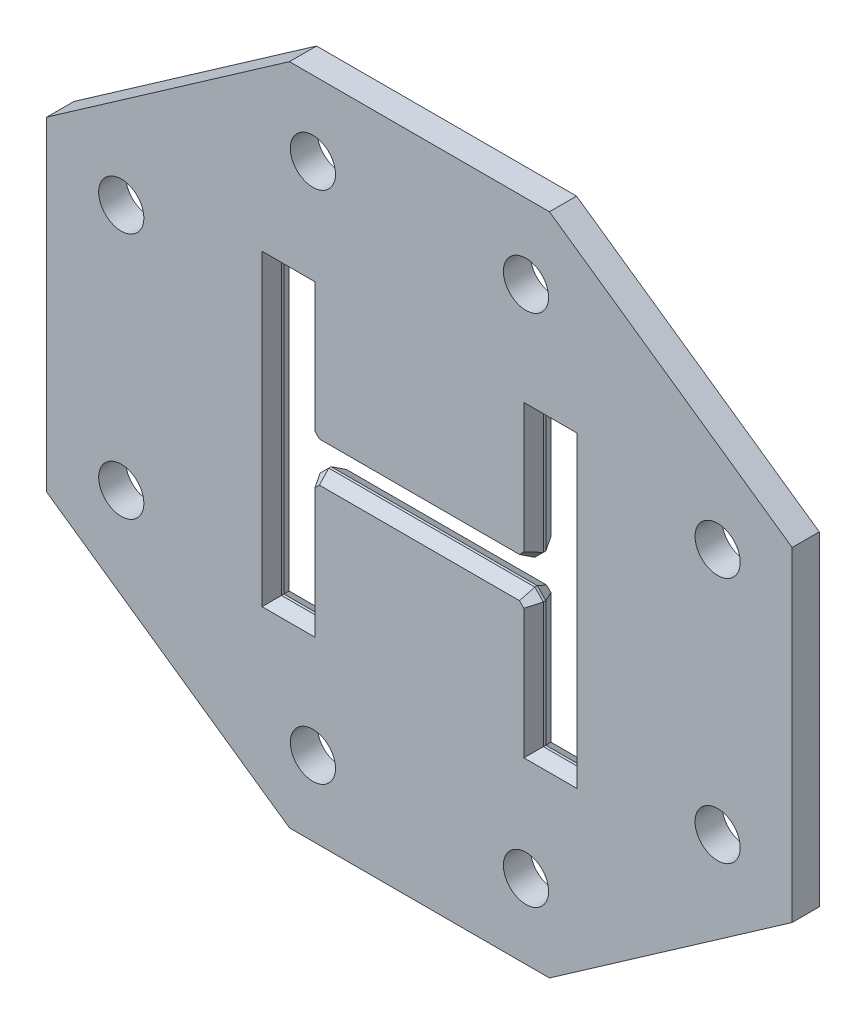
ISO-10303-21;
HEADER;
FILE_DESCRIPTION(('STEP AP214'),'2;1');
FILE_NAME('part.step','',(''),(''),'','','');
FILE_SCHEMA(('AUTOMOTIVE_DESIGN { 1 0 10303 214 1 1 1 1 }'));
ENDSEC;
DATA;
#1=APPLICATION_CONTEXT('core data for automotive mechanical design processes');
#2=APPLICATION_PROTOCOL_DEFINITION('international standard','automotive_design',2000,#1);
#3=PRODUCT_CONTEXT('',#1,'mechanical');
#4=PRODUCT('Part','Part','',(#3));
#5=PRODUCT_RELATED_PRODUCT_CATEGORY('part','',(#4));
#6=PRODUCT_DEFINITION_FORMATION('','',#4);
#7=PRODUCT_DEFINITION_CONTEXT('part definition',#1,'design');
#8=PRODUCT_DEFINITION('design','',#6,#7);
#9=PRODUCT_DEFINITION_SHAPE('','',#8);
#10=(LENGTH_UNIT() NAMED_UNIT(*) SI_UNIT(.MILLI.,.METRE.));
#11=(NAMED_UNIT(*) PLANE_ANGLE_UNIT() SI_UNIT($,.RADIAN.));
#12=(NAMED_UNIT(*) SI_UNIT($,.STERADIAN.) SOLID_ANGLE_UNIT());
#13=UNCERTAINTY_MEASURE_WITH_UNIT(LENGTH_MEASURE(1.E-05),#10,'distance_accuracy_value','');
#14=(GEOMETRIC_REPRESENTATION_CONTEXT(3) GLOBAL_UNCERTAINTY_ASSIGNED_CONTEXT((#13)) GLOBAL_UNIT_ASSIGNED_CONTEXT((#10,
#11,#12)) REPRESENTATION_CONTEXT('',''));
#15=CARTESIAN_POINT('',(0.,0.,0.));
#16=DIRECTION('',(0.,0.,1.));
#17=DIRECTION('',(1.,0.,0.));
#18=AXIS2_PLACEMENT_3D('',#15,#16,#17);
#19=CARTESIAN_POINT('',(156.845,-230.378,19.05));
#20=DIRECTION('',(1.,0.,0.));
#21=DIRECTION('',(0.,0.,-1.));
#22=AXIS2_PLACEMENT_3D('',#19,#20,#21);
#23=PLANE('',#22);
#24=DIRECTION('',(0.,0.,-1.));
#25=VECTOR('',#24,1.);
#26=CARTESIAN_POINT('',(156.845,-206.3115,19.05));
#27=LINE('',#26,#25);
#28=CARTESIAN_POINT('',(156.845,-206.3115,1.72949192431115));
#29=VERTEX_POINT('',#28);
#30=CARTESIAN_POINT('',(156.845,-206.3115,-1.72949192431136));
#31=VERTEX_POINT('',#30);
#32=EDGE_CURVE('E704',#29,#31,#27,.T.);
#33=ORIENTED_EDGE('',*,*,#32,.T.);
#34=DIRECTION('',(0.,1.,0.));
#35=VECTOR('',#34,1.);
#36=CARTESIAN_POINT('',(156.845,-230.378,-1.72949192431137));
#37=LINE('',#36,#35);
#38=CARTESIAN_POINT('',(156.845,-30.1624999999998,-1.72949192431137));
#39=VERTEX_POINT('',#38);
#40=EDGE_CURVE('E58',#31,#39,#37,.T.);
#41=ORIENTED_EDGE('',*,*,#40,.T.);
#42=DIRECTION('',(0.,0.,-1.));
#43=VECTOR('',#42,1.);
#44=CARTESIAN_POINT('',(156.845,-30.1624999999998,19.05));
#45=LINE('',#44,#43);
#46=CARTESIAN_POINT('',(156.845,-30.1624999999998,1.72949192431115));
#47=VERTEX_POINT('',#46);
#48=EDGE_CURVE('E709',#47,#39,#45,.T.);
#49=ORIENTED_EDGE('',*,*,#48,.F.);
#50=DIRECTION('',(0.,-1.,0.));
#51=VECTOR('',#50,1.);
#52=CARTESIAN_POINT('',(156.845,-206.3115,1.72949192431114));
#53=LINE('',#52,#51);
#54=EDGE_CURVE('E439',#47,#29,#53,.T.);
#55=ORIENTED_EDGE('',*,*,#54,.T.);
#56=EDGE_LOOP('',(#33,#41,#49,#55));
#57=FACE_BOUND('',#56,.T.);
#58=ADVANCED_FACE('F47',(#57),#23,.T.);
#59=CARTESIAN_POINT('',(-156.845,230.378,19.05));
#60=DIRECTION('',(-1.,0.,0.));
#61=DIRECTION('',(0.,0.,1.));
#62=AXIS2_PLACEMENT_3D('',#59,#60,#61);
#63=PLANE('',#62);
#64=DIRECTION('',(0.,0.,-1.));
#65=VECTOR('',#64,1.);
#66=CARTESIAN_POINT('',(-156.845,206.3115,19.05));
#67=LINE('',#66,#65);
#68=CARTESIAN_POINT('',(-156.845,206.3115,1.72949192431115));
#69=VERTEX_POINT('',#68);
#70=CARTESIAN_POINT('',(-156.845,206.3115,-1.72949192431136));
#71=VERTEX_POINT('',#70);
#72=EDGE_CURVE('E733',#69,#71,#67,.T.);
#73=ORIENTED_EDGE('',*,*,#72,.T.);
#74=DIRECTION('',(0.,-1.,0.));
#75=VECTOR('',#74,1.);
#76=CARTESIAN_POINT('',(-156.845,230.378,-1.72949192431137));
#77=LINE('',#76,#75);
#78=CARTESIAN_POINT('',(-156.845,30.1625000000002,-1.72949192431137));
#79=VERTEX_POINT('',#78);
#80=EDGE_CURVE('E573',#71,#79,#77,.T.);
#81=ORIENTED_EDGE('',*,*,#80,.T.);
#82=DIRECTION('',(0.,0.,-1.));
#83=VECTOR('',#82,1.);
#84=CARTESIAN_POINT('',(-156.845,30.1625000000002,19.05));
#85=LINE('',#84,#83);
#86=CARTESIAN_POINT('',(-156.845,30.1625000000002,1.72949192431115));
#87=VERTEX_POINT('',#86);
#88=EDGE_CURVE('E736',#87,#79,#85,.T.);
#89=ORIENTED_EDGE('',*,*,#88,.F.);
#90=DIRECTION('',(0.,1.,0.));
#91=VECTOR('',#90,1.);
#92=CARTESIAN_POINT('',(-156.845,206.3115,1.72949192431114));
#93=LINE('',#92,#91);
#94=EDGE_CURVE('E416',#87,#69,#93,.T.);
#95=ORIENTED_EDGE('',*,*,#94,.T.);
#96=EDGE_LOOP('',(#73,#81,#89,#95));
#97=FACE_BOUND('',#96,.T.);
#98=ADVANCED_FACE('F833',(#97),#63,.T.);
#99=CARTESIAN_POINT('',(0.,0.,19.05));
#100=DIRECTION('',(0.,0.,-1.));
#101=DIRECTION('',(-1.,0.,0.));
#102=AXIS2_PLACEMENT_3D('',#99,#100,#101);
#103=PLANE('',#102);
#104=DIRECTION('',(0.,-1.,0.));
#105=VECTOR('',#104,1.);
#106=CARTESIAN_POINT('',(221.201,-206.3115,19.05));
#107=LINE('',#106,#105);
#108=CARTESIAN_POINT('',(221.201,216.3115,19.05));
#109=VERTEX_POINT('',#108);
#110=CARTESIAN_POINT('',(221.201,-216.3115,19.05));
#111=VERTEX_POINT('',#110);
#112=EDGE_CURVE('E392',#109,#111,#107,.T.);
#113=ORIENTED_EDGE('',*,*,#112,.T.);
#114=DIRECTION('',(-1.,0.,0.));
#115=VECTOR('',#114,1.);
#116=CARTESIAN_POINT('',(156.845,-216.3115,19.05));
#117=LINE('',#116,#115);
#118=CARTESIAN_POINT('',(146.845,-216.3115,19.05));
#119=VERTEX_POINT('',#118);
#120=EDGE_CURVE('E391',#111,#119,#117,.T.);
#121=ORIENTED_EDGE('',*,*,#120,.T.);
#122=DIRECTION('',(0.,1.,0.));
#123=VECTOR('',#122,1.);
#124=CARTESIAN_POINT('',(146.845,-30.1624999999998,19.05));
#125=LINE('',#124,#123);
#126=CARTESIAN_POINT('',(146.845,-34.3046356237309,19.05));
#127=VERTEX_POINT('',#126);
#128=EDGE_CURVE('E341',#119,#127,#125,.T.);
#129=ORIENTED_EDGE('',*,*,#128,.T.);
#130=DIRECTION('',(-0.707106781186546,0.707106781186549,0.));
#131=VECTOR('',#130,1.);
#132=CARTESIAN_POINT('',(137.708932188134,-25.1685678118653,19.05));
#133=LINE('',#132,#131);
#134=CARTESIAN_POINT('',(140.637864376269,-28.0974999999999,19.05));
#135=VERTEX_POINT('',#134);
#136=EDGE_CURVE('E352',#127,#135,#133,.T.);
#137=ORIENTED_EDGE('',*,*,#136,.T.);
#138=DIRECTION('',(-1.,0.,0.));
#139=VECTOR('',#138,1.);
#140=CARTESIAN_POINT('',(-144.78,-28.0974999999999,19.05));
#141=LINE('',#140,#139);
#142=CARTESIAN_POINT('',(-140.637864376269,-28.0974999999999,19.05));
#143=VERTEX_POINT('',#142);
#144=EDGE_CURVE('E355',#135,#143,#141,.T.);
#145=ORIENTED_EDGE('',*,*,#144,.T.);
#146=DIRECTION('',(-0.707106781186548,-0.707106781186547,0.));
#147=VECTOR('',#146,1.);
#148=CARTESIAN_POINT('',(-149.773932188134,-37.2335678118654,19.05));
#149=LINE('',#148,#147);
#150=CARTESIAN_POINT('',(-146.845,-34.3046356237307,19.05));
#151=VERTEX_POINT('',#150);
#152=EDGE_CURVE('E356',#143,#151,#149,.T.);
#153=ORIENTED_EDGE('',*,*,#152,.T.);
#154=DIRECTION('',(0.,-1.,0.));
#155=VECTOR('',#154,1.);
#156=CARTESIAN_POINT('',(-146.845,-206.3115,19.05));
#157=LINE('',#156,#155);
#158=CARTESIAN_POINT('',(-146.845,-216.3115,19.05));
#159=VERTEX_POINT('',#158);
#160=EDGE_CURVE('E363',#151,#159,#157,.T.);
#161=ORIENTED_EDGE('',*,*,#160,.T.);
#162=DIRECTION('',(-1.,0.,0.));
#163=VECTOR('',#162,1.);
#164=CARTESIAN_POINT('',(-211.201,-216.3115,19.05));
#165=LINE('',#164,#163);
#166=CARTESIAN_POINT('',(-221.201,-216.3115,19.05));
#167=VERTEX_POINT('',#166);
#168=EDGE_CURVE('E364',#159,#167,#165,.T.);
#169=ORIENTED_EDGE('',*,*,#168,.T.);
#170=DIRECTION('',(0.,1.,0.));
#171=VECTOR('',#170,1.);
#172=CARTESIAN_POINT('',(-221.201,206.3115,19.05));
#173=LINE('',#172,#171);
#174=CARTESIAN_POINT('',(-221.201,216.3115,19.05));
#175=VERTEX_POINT('',#174);
#176=EDGE_CURVE('E370',#167,#175,#173,.T.);
#177=ORIENTED_EDGE('',*,*,#176,.T.);
#178=DIRECTION('',(1.,0.,0.));
#179=VECTOR('',#178,1.);
#180=CARTESIAN_POINT('',(-156.845,216.3115,19.05));
#181=LINE('',#180,#179);
#182=CARTESIAN_POINT('',(-146.845,216.3115,19.05));
#183=VERTEX_POINT('',#182);
#184=EDGE_CURVE('E369',#175,#183,#181,.T.);
#185=ORIENTED_EDGE('',*,*,#184,.T.);
#186=DIRECTION('',(0.,-1.,0.));
#187=VECTOR('',#186,1.);
#188=CARTESIAN_POINT('',(-146.845,30.1625000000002,19.05));
#189=LINE('',#188,#187);
#190=CARTESIAN_POINT('',(-146.845,34.3046356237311,19.05));
#191=VERTEX_POINT('',#190);
#192=EDGE_CURVE('E373',#183,#191,#189,.T.);
#193=ORIENTED_EDGE('',*,*,#192,.T.);
#194=DIRECTION('',(0.707106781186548,-0.707106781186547,0.));
#195=VECTOR('',#194,1.);
#196=CARTESIAN_POINT('',(-137.708932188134,25.1685678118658,19.05));
#197=LINE('',#196,#195);
#198=CARTESIAN_POINT('',(-140.637864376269,28.0975000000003,19.05));
#199=VERTEX_POINT('',#198);
#200=EDGE_CURVE('E376',#191,#199,#197,.T.);
#201=ORIENTED_EDGE('',*,*,#200,.T.);
#202=DIRECTION('',(1.,0.,0.));
#203=VECTOR('',#202,1.);
#204=CARTESIAN_POINT('',(144.78,28.0975000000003,19.05));
#205=LINE('',#204,#203);
#206=CARTESIAN_POINT('',(140.637864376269,28.0975000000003,19.05));
#207=VERTEX_POINT('',#206);
#208=EDGE_CURVE('E378',#199,#207,#205,.T.);
#209=ORIENTED_EDGE('',*,*,#208,.T.);
#210=DIRECTION('',(0.707106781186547,0.707106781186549,0.));
#211=VECTOR('',#210,1.);
#212=CARTESIAN_POINT('',(149.773932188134,37.2335678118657,19.05));
#213=LINE('',#212,#211);
#214=CARTESIAN_POINT('',(146.845,34.3046356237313,19.05));
#215=VERTEX_POINT('',#214);
#216=EDGE_CURVE('E385',#207,#215,#213,.T.);
#217=ORIENTED_EDGE('',*,*,#216,.T.);
#218=DIRECTION('',(0.,1.,0.));
#219=VECTOR('',#218,1.);
#220=CARTESIAN_POINT('',(146.845,206.3115,19.05));
#221=LINE('',#220,#219);
#222=CARTESIAN_POINT('',(146.845,216.3115,19.05));
#223=VERTEX_POINT('',#222);
#224=EDGE_CURVE('E383',#215,#223,#221,.T.);
#225=ORIENTED_EDGE('',*,*,#224,.T.);
#226=DIRECTION('',(1.,0.,0.));
#227=VECTOR('',#226,1.);
#228=CARTESIAN_POINT('',(211.201,216.3115,19.05));
#229=LINE('',#228,#227);
#230=EDGE_CURVE('E390',#223,#109,#229,.T.);
#231=ORIENTED_EDGE('',*,*,#230,.T.);
#232=EDGE_LOOP('',(#113,#121,#129,#137,#145,#153,#161,#169,#177,#185,#193,#201,#209,#217,#225,#231));
#233=FACE_BOUND('',#232,.T.);
#234=CARTESIAN_POINT('',(-149.758610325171,-361.549268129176,19.05));
#235=DIRECTION('',(0.,0.,1.));
#236=DIRECTION('',(1.,0.,0.));
#237=AXIS2_PLACEMENT_3D('',#234,#235,#236);
#238=CIRCLE('',#237,31.75);
#239=CARTESIAN_POINT('',(-118.008610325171,-361.549268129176,19.05));
#240=VERTEX_POINT('',#239);
#241=EDGE_CURVE('E1667',#240,#240,#238,.T.);
#242=ORIENTED_EDGE('',*,*,#241,.F.);
#243=EDGE_LOOP('',(#242));
#244=FACE_BOUND('',#243,.T.);
#245=CARTESIAN_POINT('',(149.758610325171,-361.549268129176,19.05));
#246=DIRECTION('',(0.,0.,1.));
#247=DIRECTION('',(1.,0.,0.));
#248=AXIS2_PLACEMENT_3D('',#245,#246,#247);
#249=CIRCLE('',#248,31.75);
#250=CARTESIAN_POINT('',(181.508610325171,-361.549268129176,19.05));
#251=VERTEX_POINT('',#250);
#252=EDGE_CURVE('E1673',#251,#251,#249,.T.);
#253=ORIENTED_EDGE('',*,*,#252,.F.);
#254=EDGE_LOOP('',(#253));
#255=FACE_BOUND('',#254,.T.);
#256=CARTESIAN_POINT('',(419.080268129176,-173.588730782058,19.05));
#257=DIRECTION('',(0.,0.,1.));
#258=DIRECTION('',(1.,0.,0.));
#259=AXIS2_PLACEMENT_3D('',#256,#257,#258);
#260=CIRCLE('',#259,31.75);
#261=CARTESIAN_POINT('',(450.830268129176,-173.588730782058,19.05));
#262=VERTEX_POINT('',#261);
#263=EDGE_CURVE('E1680',#262,#262,#260,.T.);
#264=ORIENTED_EDGE('',*,*,#263,.F.);
#265=EDGE_LOOP('',(#264));
#266=FACE_BOUND('',#265,.T.);
#267=CARTESIAN_POINT('',(419.080268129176,173.588730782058,19.05));
#268=DIRECTION('',(0.,0.,1.));
#269=DIRECTION('',(1.,0.,0.));
#270=AXIS2_PLACEMENT_3D('',#267,#268,#269);
#271=CIRCLE('',#270,31.75);
#272=CARTESIAN_POINT('',(450.830268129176,173.588730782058,19.05));
#273=VERTEX_POINT('',#272);
#274=EDGE_CURVE('E1682',#273,#273,#271,.T.);
#275=ORIENTED_EDGE('',*,*,#274,.F.);
#276=EDGE_LOOP('',(#275));
#277=FACE_BOUND('',#276,.T.);
#278=CARTESIAN_POINT('',(149.758610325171,361.549268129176,19.05));
#279=DIRECTION('',(0.,0.,1.));
#280=DIRECTION('',(1.,0.,0.));
#281=AXIS2_PLACEMENT_3D('',#278,#279,#280);
#282=CIRCLE('',#281,31.75);
#283=CARTESIAN_POINT('',(181.508610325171,361.549268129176,19.05));
#284=VERTEX_POINT('',#283);
#285=EDGE_CURVE('E1683',#284,#284,#282,.T.);
#286=ORIENTED_EDGE('',*,*,#285,.F.);
#287=EDGE_LOOP('',(#286));
#288=FACE_BOUND('',#287,.T.);
#289=CARTESIAN_POINT('',(-149.758610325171,361.549268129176,19.05));
#290=DIRECTION('',(0.,0.,1.));
#291=DIRECTION('',(1.,0.,0.));
#292=AXIS2_PLACEMENT_3D('',#289,#290,#291);
#293=CIRCLE('',#292,31.75);
#294=CARTESIAN_POINT('',(-118.008610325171,361.549268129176,19.05));
#295=VERTEX_POINT('',#294);
#296=EDGE_CURVE('E1686',#295,#295,#293,.T.);
#297=ORIENTED_EDGE('',*,*,#296,.F.);
#298=EDGE_LOOP('',(#297));
#299=FACE_BOUND('',#298,.T.);
#300=CARTESIAN_POINT('',(-419.080268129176,173.588730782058,19.05));
#301=DIRECTION('',(0.,0.,1.));
#302=DIRECTION('',(1.,0.,0.));
#303=AXIS2_PLACEMENT_3D('',#300,#301,#302);
#304=CIRCLE('',#303,31.75);
#305=CARTESIAN_POINT('',(-387.330268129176,173.588730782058,19.05));
#306=VERTEX_POINT('',#305);
#307=EDGE_CURVE('E1694',#306,#306,#304,.T.);
#308=ORIENTED_EDGE('',*,*,#307,.F.);
#309=EDGE_LOOP('',(#308));
#310=FACE_BOUND('',#309,.T.);
#311=CARTESIAN_POINT('',(-419.080268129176,-173.588730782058,19.05));
#312=DIRECTION('',(0.,0.,1.));
#313=DIRECTION('',(1.,0.,0.));
#314=AXIS2_PLACEMENT_3D('',#311,#312,#313);
#315=CIRCLE('',#314,31.75);
#316=CARTESIAN_POINT('',(-387.330268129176,-173.588730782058,19.05));
#317=VERTEX_POINT('',#316);
#318=EDGE_CURVE('E1696',#317,#317,#315,.T.);
#319=ORIENTED_EDGE('',*,*,#318,.F.);
#320=EDGE_LOOP('',(#319));
#321=FACE_BOUND('',#320,.T.);
#322=DIRECTION('',(0.,-1.,0.));
#323=VECTOR('',#322,1.);
#324=CARTESIAN_POINT('',(-523.855268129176,-228.234235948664,19.05));
#325=LINE('',#324,#323);
#326=CARTESIAN_POINT('',(-523.855268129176,228.234235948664,19.05));
#327=VERTEX_POINT('',#326);
#328=CARTESIAN_POINT('',(-523.855268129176,-228.234235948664,19.05));
#329=VERTEX_POINT('',#328);
#330=EDGE_CURVE('E325',#327,#329,#325,.T.);
#331=ORIENTED_EDGE('',*,*,#330,.T.);
#332=DIRECTION('',(0.820038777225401,-0.572307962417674,0.));
#333=VECTOR('',#332,1.);
#334=CARTESIAN_POINT('',(-182.70492307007,-466.324268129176,19.05));
#335=LINE('',#334,#333);
#336=CARTESIAN_POINT('',(-182.70492307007,-466.324268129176,19.05));
#337=VERTEX_POINT('',#336);
#338=EDGE_CURVE('E311',#329,#337,#335,.T.);
#339=ORIENTED_EDGE('',*,*,#338,.T.);
#340=DIRECTION('',(1.,0.,0.));
#341=VECTOR('',#340,1.);
#342=CARTESIAN_POINT('',(182.70492307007,-466.324268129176,19.05));
#343=LINE('',#342,#341);
#344=CARTESIAN_POINT('',(182.70492307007,-466.324268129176,19.05));
#345=VERTEX_POINT('',#344);
#346=EDGE_CURVE('E324',#337,#345,#343,.T.);
#347=ORIENTED_EDGE('',*,*,#346,.T.);
#348=DIRECTION('',(0.820038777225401,0.572307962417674,0.));
#349=VECTOR('',#348,1.);
#350=CARTESIAN_POINT('',(523.855268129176,-228.234235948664,19.05));
#351=LINE('',#350,#349);
#352=CARTESIAN_POINT('',(523.855268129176,-228.234235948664,19.05));
#353=VERTEX_POINT('',#352);
#354=EDGE_CURVE('E745',#345,#353,#351,.T.);
#355=ORIENTED_EDGE('',*,*,#354,.T.);
#356=DIRECTION('',(0.,1.,0.));
#357=VECTOR('',#356,1.);
#358=CARTESIAN_POINT('',(523.855268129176,228.234235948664,19.05));
#359=LINE('',#358,#357);
#360=CARTESIAN_POINT('',(523.855268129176,228.234235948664,19.05));
#361=VERTEX_POINT('',#360);
#362=EDGE_CURVE('E746',#353,#361,#359,.T.);
#363=ORIENTED_EDGE('',*,*,#362,.T.);
#364=DIRECTION('',(-0.820038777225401,0.572307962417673,0.));
#365=VECTOR('',#364,1.);
#366=CARTESIAN_POINT('',(182.70492307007,466.324268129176,19.05));
#367=LINE('',#366,#365);
#368=CARTESIAN_POINT('',(182.70492307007,466.324268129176,19.05));
#369=VERTEX_POINT('',#368);
#370=EDGE_CURVE('E753',#361,#369,#367,.T.);
#371=ORIENTED_EDGE('',*,*,#370,.T.);
#372=DIRECTION('',(-1.,0.,0.));
#373=VECTOR('',#372,1.);
#374=CARTESIAN_POINT('',(-182.704923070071,466.324268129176,19.05));
#375=LINE('',#374,#373);
#376=CARTESIAN_POINT('',(-182.704923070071,466.324268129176,19.05));
#377=VERTEX_POINT('',#376);
#378=EDGE_CURVE('E754',#369,#377,#375,.T.);
#379=ORIENTED_EDGE('',*,*,#378,.T.);
#380=DIRECTION('',(-0.8200387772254,-0.572307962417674,0.));
#381=VECTOR('',#380,1.);
#382=CARTESIAN_POINT('',(-523.855268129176,228.234235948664,19.05));
#383=LINE('',#382,#381);
#384=EDGE_CURVE('E329',#377,#327,#383,.T.);
#385=ORIENTED_EDGE('',*,*,#384,.T.);
#386=EDGE_LOOP('',(#331,#339,#347,#355,#363,#371,#379,#385));
#387=FACE_BOUND('',#386,.T.);
#388=ADVANCED_FACE('F327',(#233,#244,#255,#266,#277,#288,#299,#310,#321,#387),#103,.F.);
#389=CARTESIAN_POINT('',(0.,0.,-19.05));
#390=DIRECTION('',(0.,0.,-1.));
#391=DIRECTION('',(-1.,0.,0.));
#392=AXIS2_PLACEMENT_3D('',#389,#390,#391);
#393=PLANE('',#392);
#394=DIRECTION('',(0.707106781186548,0.707106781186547,0.));
#395=VECTOR('',#394,1.);
#396=CARTESIAN_POINT('',(-56.2701821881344,56.2701821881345,-19.05));
#397=LINE('',#396,#395);
#398=CARTESIAN_POINT('',(-146.845,-34.3046356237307,-19.05));
#399=VERTEX_POINT('',#398);
#400=CARTESIAN_POINT('',(-140.637864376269,-28.0974999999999,-19.05));
#401=VERTEX_POINT('',#400);
#402=EDGE_CURVE('E549',#399,#401,#397,.T.);
#403=ORIENTED_EDGE('',*,*,#402,.T.);
#404=DIRECTION('',(1.,0.,0.));
#405=VECTOR('',#404,1.);
#406=CARTESIAN_POINT('',(0.,-28.0974999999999,-19.05));
#407=LINE('',#406,#405);
#408=CARTESIAN_POINT('',(140.637864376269,-28.0974999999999,-19.05));
#409=VERTEX_POINT('',#408);
#410=EDGE_CURVE('E553',#401,#409,#407,.T.);
#411=ORIENTED_EDGE('',*,*,#410,.T.);
#412=DIRECTION('',(0.707106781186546,-0.707106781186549,0.));
#413=VECTOR('',#412,1.);
#414=CARTESIAN_POINT('',(56.2701821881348,56.2701821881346,-19.05));
#415=LINE('',#414,#413);
#416=CARTESIAN_POINT('',(146.845,-34.3046356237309,-19.05));
#417=VERTEX_POINT('',#416);
#418=EDGE_CURVE('E442',#409,#417,#415,.T.);
#419=ORIENTED_EDGE('',*,*,#418,.T.);
#420=DIRECTION('',(0.,-1.,0.));
#421=VECTOR('',#420,1.);
#422=CARTESIAN_POINT('',(146.845,0.,-19.05));
#423=LINE('',#422,#421);
#424=CARTESIAN_POINT('',(146.845,-216.3115,-19.05));
#425=VERTEX_POINT('',#424);
#426=EDGE_CURVE('E508',#417,#425,#423,.T.);
#427=ORIENTED_EDGE('',*,*,#426,.T.);
#428=DIRECTION('',(1.,0.,0.));
#429=VECTOR('',#428,1.);
#430=CARTESIAN_POINT('',(0.,-216.3115,-19.05));
#431=LINE('',#430,#429);
#432=CARTESIAN_POINT('',(221.201,-216.3115,-19.05));
#433=VERTEX_POINT('',#432);
#434=EDGE_CURVE('E515',#425,#433,#431,.T.);
#435=ORIENTED_EDGE('',*,*,#434,.T.);
#436=DIRECTION('',(0.,1.,0.));
#437=VECTOR('',#436,1.);
#438=CARTESIAN_POINT('',(221.201,0.,-19.05));
#439=LINE('',#438,#437);
#440=CARTESIAN_POINT('',(221.201,216.3115,-19.05));
#441=VERTEX_POINT('',#440);
#442=EDGE_CURVE('E513',#433,#441,#439,.T.);
#443=ORIENTED_EDGE('',*,*,#442,.T.);
#444=DIRECTION('',(-1.,0.,0.));
#445=VECTOR('',#444,1.);
#446=CARTESIAN_POINT('',(0.,216.3115,-19.05));
#447=LINE('',#446,#445);
#448=CARTESIAN_POINT('',(146.845,216.3115,-19.05));
#449=VERTEX_POINT('',#448);
#450=EDGE_CURVE('E520',#441,#449,#447,.T.);
#451=ORIENTED_EDGE('',*,*,#450,.T.);
#452=DIRECTION('',(0.,-1.,0.));
#453=VECTOR('',#452,1.);
#454=CARTESIAN_POINT('',(146.845,0.,-19.05));
#455=LINE('',#454,#453);
#456=CARTESIAN_POINT('',(146.845,34.3046356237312,-19.05));
#457=VERTEX_POINT('',#456);
#458=EDGE_CURVE('E522',#449,#457,#455,.T.);
#459=ORIENTED_EDGE('',*,*,#458,.T.);
#460=DIRECTION('',(-0.707106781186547,-0.707106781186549,0.));
#461=VECTOR('',#460,1.);
#462=CARTESIAN_POINT('',(56.2701821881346,-56.2701821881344,-19.05));
#463=LINE('',#462,#461);
#464=CARTESIAN_POINT('',(140.637864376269,28.0975000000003,-19.05));
#465=VERTEX_POINT('',#464);
#466=EDGE_CURVE('E521',#457,#465,#463,.T.);
#467=ORIENTED_EDGE('',*,*,#466,.T.);
#468=DIRECTION('',(-1.,0.,0.));
#469=VECTOR('',#468,1.);
#470=CARTESIAN_POINT('',(0.,28.0975000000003,-19.05));
#471=LINE('',#470,#469);
#472=CARTESIAN_POINT('',(-140.637864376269,28.0975000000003,-19.05));
#473=VERTEX_POINT('',#472);
#474=EDGE_CURVE('E527',#465,#473,#471,.T.);
#475=ORIENTED_EDGE('',*,*,#474,.T.);
#476=DIRECTION('',(-0.707106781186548,0.707106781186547,0.));
#477=VECTOR('',#476,1.);
#478=CARTESIAN_POINT('',(-56.2701821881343,-56.2701821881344,-19.05));
#479=LINE('',#478,#477);
#480=CARTESIAN_POINT('',(-146.845,34.3046356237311,-19.05));
#481=VERTEX_POINT('',#480);
#482=EDGE_CURVE('E530',#473,#481,#479,.T.);
#483=ORIENTED_EDGE('',*,*,#482,.T.);
#484=DIRECTION('',(0.,1.,0.));
#485=VECTOR('',#484,1.);
#486=CARTESIAN_POINT('',(-146.845,0.,-19.05));
#487=LINE('',#486,#485);
#488=CARTESIAN_POINT('',(-146.845,216.3115,-19.05));
#489=VERTEX_POINT('',#488);
#490=EDGE_CURVE('E531',#481,#489,#487,.T.);
#491=ORIENTED_EDGE('',*,*,#490,.T.);
#492=DIRECTION('',(-1.,0.,0.));
#493=VECTOR('',#492,1.);
#494=CARTESIAN_POINT('',(6.62725387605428E-13,216.3115,-19.05));
#495=LINE('',#494,#493);
#496=CARTESIAN_POINT('',(-221.201,216.3115,-19.05));
#497=VERTEX_POINT('',#496);
#498=EDGE_CURVE('E537',#489,#497,#495,.T.);
#499=ORIENTED_EDGE('',*,*,#498,.T.);
#500=DIRECTION('',(0.,-1.,0.));
#501=VECTOR('',#500,1.);
#502=CARTESIAN_POINT('',(-221.201,0.,-19.05));
#503=LINE('',#502,#501);
#504=CARTESIAN_POINT('',(-221.201,-216.3115,-19.05));
#505=VERTEX_POINT('',#504);
#506=EDGE_CURVE('E536',#497,#505,#503,.T.);
#507=ORIENTED_EDGE('',*,*,#506,.T.);
#508=DIRECTION('',(1.,0.,0.));
#509=VECTOR('',#508,1.);
#510=CARTESIAN_POINT('',(0.,-216.3115,-19.05));
#511=LINE('',#510,#509);
#512=CARTESIAN_POINT('',(-146.845,-216.3115,-19.05));
#513=VERTEX_POINT('',#512);
#514=EDGE_CURVE('E545',#505,#513,#511,.T.);
#515=ORIENTED_EDGE('',*,*,#514,.T.);
#516=DIRECTION('',(0.,1.,0.));
#517=VECTOR('',#516,1.);
#518=CARTESIAN_POINT('',(-146.845,0.,-19.05));
#519=LINE('',#518,#517);
#520=EDGE_CURVE('E543',#513,#399,#519,.T.);
#521=ORIENTED_EDGE('',*,*,#520,.T.);
#522=EDGE_LOOP('',(#403,#411,#419,#427,#435,#443,#451,#459,#467,#475,#483,#491,#499,#507,#515,#521));
#523=FACE_BOUND('',#522,.T.);
#524=CARTESIAN_POINT('',(-149.758610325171,-361.549268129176,-19.05));
#525=DIRECTION('',(0.,0.,1.));
#526=DIRECTION('',(1.,0.,0.));
#527=AXIS2_PLACEMENT_3D('',#524,#525,#526);
#528=CIRCLE('',#527,31.75);
#529=CARTESIAN_POINT('',(-118.008610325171,-361.549268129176,-19.05));
#530=VERTEX_POINT('',#529);
#531=EDGE_CURVE('E506',#530,#530,#528,.T.);
#532=ORIENTED_EDGE('',*,*,#531,.T.);
#533=EDGE_LOOP('',(#532));
#534=FACE_BOUND('',#533,.T.);
#535=CARTESIAN_POINT('',(149.758610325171,-361.549268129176,-19.05));
#536=DIRECTION('',(0.,0.,1.));
#537=DIRECTION('',(1.,0.,0.));
#538=AXIS2_PLACEMENT_3D('',#535,#536,#537);
#539=CIRCLE('',#538,31.75);
#540=CARTESIAN_POINT('',(181.508610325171,-361.549268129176,-19.05));
#541=VERTEX_POINT('',#540);
#542=EDGE_CURVE('E1710',#541,#541,#539,.T.);
#543=ORIENTED_EDGE('',*,*,#542,.T.);
#544=EDGE_LOOP('',(#543));
#545=FACE_BOUND('',#544,.T.);
#546=CARTESIAN_POINT('',(419.080268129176,-173.588730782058,-19.05));
#547=DIRECTION('',(0.,0.,1.));
#548=DIRECTION('',(1.,0.,0.));
#549=AXIS2_PLACEMENT_3D('',#546,#547,#548);
#550=CIRCLE('',#549,31.75);
#551=CARTESIAN_POINT('',(450.830268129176,-173.588730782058,-19.05));
#552=VERTEX_POINT('',#551);
#553=EDGE_CURVE('E1711',#552,#552,#550,.T.);
#554=ORIENTED_EDGE('',*,*,#553,.T.);
#555=EDGE_LOOP('',(#554));
#556=FACE_BOUND('',#555,.T.);
#557=CARTESIAN_POINT('',(419.080268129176,173.588730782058,-19.05));
#558=DIRECTION('',(0.,0.,1.));
#559=DIRECTION('',(1.,0.,0.));
#560=AXIS2_PLACEMENT_3D('',#557,#558,#559);
#561=CIRCLE('',#560,31.75);
#562=CARTESIAN_POINT('',(450.830268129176,173.588730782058,-19.05));
#563=VERTEX_POINT('',#562);
#564=EDGE_CURVE('E1720',#563,#563,#561,.T.);
#565=ORIENTED_EDGE('',*,*,#564,.T.);
#566=EDGE_LOOP('',(#565));
#567=FACE_BOUND('',#566,.T.);
#568=CARTESIAN_POINT('',(149.758610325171,361.549268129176,-19.05));
#569=DIRECTION('',(0.,0.,1.));
#570=DIRECTION('',(1.,0.,0.));
#571=AXIS2_PLACEMENT_3D('',#568,#569,#570);
#572=CIRCLE('',#571,31.75);
#573=CARTESIAN_POINT('',(181.508610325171,361.549268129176,-19.05));
#574=VERTEX_POINT('',#573);
#575=EDGE_CURVE('E1728',#574,#574,#572,.T.);
#576=ORIENTED_EDGE('',*,*,#575,.T.);
#577=EDGE_LOOP('',(#576));
#578=FACE_BOUND('',#577,.T.);
#579=CARTESIAN_POINT('',(-149.758610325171,361.549268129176,-19.05));
#580=DIRECTION('',(0.,0.,1.));
#581=DIRECTION('',(1.,0.,0.));
#582=AXIS2_PLACEMENT_3D('',#579,#580,#581);
#583=CIRCLE('',#582,31.75);
#584=CARTESIAN_POINT('',(-118.008610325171,361.549268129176,-19.05));
#585=VERTEX_POINT('',#584);
#586=EDGE_CURVE('E1735',#585,#585,#583,.T.);
#587=ORIENTED_EDGE('',*,*,#586,.T.);
#588=EDGE_LOOP('',(#587));
#589=FACE_BOUND('',#588,.T.);
#590=CARTESIAN_POINT('',(-419.080268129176,173.588730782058,-19.05));
#591=DIRECTION('',(0.,0.,1.));
#592=DIRECTION('',(1.,0.,0.));
#593=AXIS2_PLACEMENT_3D('',#590,#591,#592);
#594=CIRCLE('',#593,31.75);
#595=CARTESIAN_POINT('',(-387.330268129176,173.588730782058,-19.05));
#596=VERTEX_POINT('',#595);
#597=EDGE_CURVE('E1701',#596,#596,#594,.T.);
#598=ORIENTED_EDGE('',*,*,#597,.T.);
#599=EDGE_LOOP('',(#598));
#600=FACE_BOUND('',#599,.T.);
#601=CARTESIAN_POINT('',(-419.080268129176,-173.588730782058,-19.05));
#602=DIRECTION('',(0.,0.,1.));
#603=DIRECTION('',(1.,0.,0.));
#604=AXIS2_PLACEMENT_3D('',#601,#602,#603);
#605=CIRCLE('',#604,31.75);
#606=CARTESIAN_POINT('',(-387.330268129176,-173.588730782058,-19.05));
#607=VERTEX_POINT('',#606);
#608=EDGE_CURVE('E691',#607,#607,#605,.T.);
#609=ORIENTED_EDGE('',*,*,#608,.T.);
#610=EDGE_LOOP('',(#609));
#611=FACE_BOUND('',#610,.T.);
#612=DIRECTION('',(0.,-1.,0.));
#613=VECTOR('',#612,1.);
#614=CARTESIAN_POINT('',(-523.855268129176,-228.234235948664,-19.05));
#615=LINE('',#614,#613);
#616=CARTESIAN_POINT('',(-523.855268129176,228.234235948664,-19.05));
#617=VERTEX_POINT('',#616);
#618=CARTESIAN_POINT('',(-523.855268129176,-228.234235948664,-19.05));
#619=VERTEX_POINT('',#618);
#620=EDGE_CURVE('E340',#617,#619,#615,.T.);
#621=ORIENTED_EDGE('',*,*,#620,.F.);
#622=DIRECTION('',(-0.8200387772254,-0.572307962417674,0.));
#623=VECTOR('',#622,1.);
#624=CARTESIAN_POINT('',(-523.855268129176,228.234235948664,-19.05));
#625=LINE('',#624,#623);
#626=CARTESIAN_POINT('',(-182.704923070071,466.324268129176,-19.05));
#627=VERTEX_POINT('',#626);
#628=EDGE_CURVE('E334',#627,#617,#625,.T.);
#629=ORIENTED_EDGE('',*,*,#628,.F.);
#630=DIRECTION('',(-1.,0.,0.));
#631=VECTOR('',#630,1.);
#632=CARTESIAN_POINT('',(-182.704923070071,466.324268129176,-19.05));
#633=LINE('',#632,#631);
#634=CARTESIAN_POINT('',(182.70492307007,466.324268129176,-19.05));
#635=VERTEX_POINT('',#634);
#636=EDGE_CURVE('E779',#635,#627,#633,.T.);
#637=ORIENTED_EDGE('',*,*,#636,.F.);
#638=DIRECTION('',(-0.820038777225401,0.572307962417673,0.));
#639=VECTOR('',#638,1.);
#640=CARTESIAN_POINT('',(182.70492307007,466.324268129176,-19.05));
#641=LINE('',#640,#639);
#642=CARTESIAN_POINT('',(523.855268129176,228.234235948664,-19.05));
#643=VERTEX_POINT('',#642);
#644=EDGE_CURVE('E771',#643,#635,#641,.T.);
#645=ORIENTED_EDGE('',*,*,#644,.F.);
#646=DIRECTION('',(0.,1.,0.));
#647=VECTOR('',#646,1.);
#648=CARTESIAN_POINT('',(523.855268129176,228.234235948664,-19.05));
#649=LINE('',#648,#647);
#650=CARTESIAN_POINT('',(523.855268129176,-228.234235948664,-19.05));
#651=VERTEX_POINT('',#650);
#652=EDGE_CURVE('E772',#651,#643,#649,.T.);
#653=ORIENTED_EDGE('',*,*,#652,.F.);
#654=DIRECTION('',(0.820038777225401,0.572307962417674,0.));
#655=VECTOR('',#654,1.);
#656=CARTESIAN_POINT('',(523.855268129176,-228.234235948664,-19.05));
#657=LINE('',#656,#655);
#658=CARTESIAN_POINT('',(182.70492307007,-466.324268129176,-19.05));
#659=VERTEX_POINT('',#658);
#660=EDGE_CURVE('E767',#659,#651,#657,.T.);
#661=ORIENTED_EDGE('',*,*,#660,.F.);
#662=DIRECTION('',(1.,0.,0.));
#663=VECTOR('',#662,1.);
#664=CARTESIAN_POINT('',(182.70492307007,-466.324268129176,-19.05));
#665=LINE('',#664,#663);
#666=CARTESIAN_POINT('',(-182.70492307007,-466.324268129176,-19.05));
#667=VERTEX_POINT('',#666);
#668=EDGE_CURVE('E764',#667,#659,#665,.T.);
#669=ORIENTED_EDGE('',*,*,#668,.F.);
#670=DIRECTION('',(0.820038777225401,-0.572307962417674,0.));
#671=VECTOR('',#670,1.);
#672=CARTESIAN_POINT('',(-182.70492307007,-466.324268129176,-19.05));
#673=LINE('',#672,#671);
#674=EDGE_CURVE('E765',#619,#667,#673,.T.);
#675=ORIENTED_EDGE('',*,*,#674,.F.);
#676=EDGE_LOOP('',(#621,#629,#637,#645,#653,#661,#669,#675));
#677=FACE_BOUND('',#676,.T.);
#678=ADVANCED_FACE('F813',(#523,#534,#545,#556,#567,#578,#589,#600,#611,#677),#393,.T.);
#679=CARTESIAN_POINT('',(-523.855268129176,-228.234235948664,19.05));
#680=DIRECTION('',(1.,0.,0.));
#681=DIRECTION('',(0.,0.,-1.));
#682=AXIS2_PLACEMENT_3D('',#679,#680,#681);
#683=PLANE('',#682);
#684=ORIENTED_EDGE('',*,*,#620,.T.);
#685=DIRECTION('',(0.,0.,-1.));
#686=VECTOR('',#685,1.);
#687=CARTESIAN_POINT('',(-523.855268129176,-228.234235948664,19.05));
#688=LINE('',#687,#686);
#689=EDGE_CURVE('E314',#329,#619,#688,.T.);
#690=ORIENTED_EDGE('',*,*,#689,.F.);
#691=ORIENTED_EDGE('',*,*,#330,.F.);
#692=DIRECTION('',(0.,0.,-1.));
#693=VECTOR('',#692,1.);
#694=CARTESIAN_POINT('',(-523.855268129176,228.234235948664,19.05));
#695=LINE('',#694,#693);
#696=EDGE_CURVE('E757',#327,#617,#695,.T.);
#697=ORIENTED_EDGE('',*,*,#696,.T.);
#698=EDGE_LOOP('',(#684,#690,#691,#697));
#699=FACE_BOUND('',#698,.T.);
#700=ADVANCED_FACE('F335',(#699),#683,.F.);
#701=CARTESIAN_POINT('',(-182.70492307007,-466.324268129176,19.05));
#702=DIRECTION('',(0.572307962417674,0.820038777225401,0.));
#703=DIRECTION('',(-0.820038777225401,0.572307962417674,0.));
#704=AXIS2_PLACEMENT_3D('',#701,#702,#703);
#705=PLANE('',#704);
#706=ORIENTED_EDGE('',*,*,#674,.T.);
#707=DIRECTION('',(0.,0.,-1.));
#708=VECTOR('',#707,1.);
#709=CARTESIAN_POINT('',(-182.70492307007,-466.324268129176,19.05));
#710=LINE('',#709,#708);
#711=EDGE_CURVE('E319',#337,#667,#710,.T.);
#712=ORIENTED_EDGE('',*,*,#711,.F.);
#713=ORIENTED_EDGE('',*,*,#338,.F.);
#714=ORIENTED_EDGE('',*,*,#689,.T.);
#715=EDGE_LOOP('',(#706,#712,#713,#714));
#716=FACE_BOUND('',#715,.T.);
#717=ADVANCED_FACE('F312',(#716),#705,.F.);
#718=CARTESIAN_POINT('',(182.70492307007,-466.324268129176,19.05));
#719=DIRECTION('',(0.,1.,0.));
#720=DIRECTION('',(0.,0.,1.));
#721=AXIS2_PLACEMENT_3D('',#718,#719,#720);
#722=PLANE('',#721);
#723=ORIENTED_EDGE('',*,*,#668,.T.);
#724=DIRECTION('',(0.,0.,-1.));
#725=VECTOR('',#724,1.);
#726=CARTESIAN_POINT('',(182.70492307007,-466.324268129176,19.05));
#727=LINE('',#726,#725);
#728=EDGE_CURVE('E347',#345,#659,#727,.T.);
#729=ORIENTED_EDGE('',*,*,#728,.F.);
#730=ORIENTED_EDGE('',*,*,#346,.F.);
#731=ORIENTED_EDGE('',*,*,#711,.T.);
#732=EDGE_LOOP('',(#723,#729,#730,#731));
#733=FACE_BOUND('',#732,.T.);
#734=ADVANCED_FACE('F822',(#733),#722,.F.);
#735=CARTESIAN_POINT('',(523.855268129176,-228.234235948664,19.05));
#736=DIRECTION('',(-0.572307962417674,0.820038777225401,0.));
#737=DIRECTION('',(-0.820038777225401,-0.572307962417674,0.));
#738=AXIS2_PLACEMENT_3D('',#735,#736,#737);
#739=PLANE('',#738);
#740=ORIENTED_EDGE('',*,*,#660,.T.);
#741=DIRECTION('',(0.,0.,-1.));
#742=VECTOR('',#741,1.);
#743=CARTESIAN_POINT('',(523.855268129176,-228.234235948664,19.05));
#744=LINE('',#743,#742);
#745=EDGE_CURVE('E797',#353,#651,#744,.T.);
#746=ORIENTED_EDGE('',*,*,#745,.F.);
#747=ORIENTED_EDGE('',*,*,#354,.F.);
#748=ORIENTED_EDGE('',*,*,#728,.T.);
#749=EDGE_LOOP('',(#740,#746,#747,#748));
#750=FACE_BOUND('',#749,.T.);
#751=ADVANCED_FACE('F803',(#750),#739,.F.);
#752=CARTESIAN_POINT('',(523.855268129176,228.234235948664,19.05));
#753=DIRECTION('',(-1.,0.,0.));
#754=DIRECTION('',(0.,-1.,0.));
#755=AXIS2_PLACEMENT_3D('',#752,#753,#754);
#756=PLANE('',#755);
#757=ORIENTED_EDGE('',*,*,#652,.T.);
#758=DIRECTION('',(0.,0.,-1.));
#759=VECTOR('',#758,1.);
#760=CARTESIAN_POINT('',(523.855268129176,228.234235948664,19.05));
#761=LINE('',#760,#759);
#762=EDGE_CURVE('E795',#361,#643,#761,.T.);
#763=ORIENTED_EDGE('',*,*,#762,.F.);
#764=ORIENTED_EDGE('',*,*,#362,.F.);
#765=ORIENTED_EDGE('',*,*,#745,.T.);
#766=EDGE_LOOP('',(#757,#763,#764,#765));
#767=FACE_BOUND('',#766,.T.);
#768=ADVANCED_FACE('F818',(#767),#756,.F.);
#769=CARTESIAN_POINT('',(182.70492307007,466.324268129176,19.05));
#770=DIRECTION('',(-0.572307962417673,-0.820038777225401,0.));
#771=DIRECTION('',(0.820038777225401,-0.572307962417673,0.));
#772=AXIS2_PLACEMENT_3D('',#769,#770,#771);
#773=PLANE('',#772);
#774=ORIENTED_EDGE('',*,*,#644,.T.);
#775=DIRECTION('',(0.,0.,-1.));
#776=VECTOR('',#775,1.);
#777=CARTESIAN_POINT('',(182.70492307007,466.324268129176,19.05));
#778=LINE('',#777,#776);
#779=EDGE_CURVE('E789',#369,#635,#778,.T.);
#780=ORIENTED_EDGE('',*,*,#779,.F.);
#781=ORIENTED_EDGE('',*,*,#370,.F.);
#782=ORIENTED_EDGE('',*,*,#762,.T.);
#783=EDGE_LOOP('',(#774,#780,#781,#782));
#784=FACE_BOUND('',#783,.T.);
#785=ADVANCED_FACE('F817',(#784),#773,.F.);
#786=CARTESIAN_POINT('',(-182.704923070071,466.324268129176,19.05));
#787=DIRECTION('',(0.,-1.,0.));
#788=DIRECTION('',(1.,0.,0.));
#789=AXIS2_PLACEMENT_3D('',#786,#787,#788);
#790=PLANE('',#789);
#791=ORIENTED_EDGE('',*,*,#636,.T.);
#792=DIRECTION('',(0.,0.,-1.));
#793=VECTOR('',#792,1.);
#794=CARTESIAN_POINT('',(-182.704923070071,466.324268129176,19.05));
#795=LINE('',#794,#793);
#796=EDGE_CURVE('E781',#377,#627,#795,.T.);
#797=ORIENTED_EDGE('',*,*,#796,.F.);
#798=ORIENTED_EDGE('',*,*,#378,.F.);
#799=ORIENTED_EDGE('',*,*,#779,.T.);
#800=EDGE_LOOP('',(#791,#797,#798,#799));
#801=FACE_BOUND('',#800,.T.);
#802=ADVANCED_FACE('F853',(#801),#790,.F.);
#803=CARTESIAN_POINT('',(-523.855268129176,228.234235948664,19.05));
#804=DIRECTION('',(0.572307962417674,-0.8200387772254,0.));
#805=DIRECTION('',(0.820038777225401,0.572307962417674,0.));
#806=AXIS2_PLACEMENT_3D('',#803,#804,#805);
#807=PLANE('',#806);
#808=ORIENTED_EDGE('',*,*,#628,.T.);
#809=ORIENTED_EDGE('',*,*,#696,.F.);
#810=ORIENTED_EDGE('',*,*,#384,.F.);
#811=ORIENTED_EDGE('',*,*,#796,.T.);
#812=EDGE_LOOP('',(#808,#809,#810,#811));
#813=FACE_BOUND('',#812,.T.);
#814=ADVANCED_FACE('F851',(#813),#807,.F.);
#815=CARTESIAN_POINT('',(156.845,54.2290000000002,19.05));
#816=DIRECTION('',(1.,0.,0.));
#817=DIRECTION('',(0.,0.,-1.));
#818=AXIS2_PLACEMENT_3D('',#815,#816,#817);
#819=PLANE('',#818);
#820=DIRECTION('',(0.,0.,-1.));
#821=VECTOR('',#820,1.);
#822=CARTESIAN_POINT('',(156.845,30.1625000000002,19.05));
#823=LINE('',#822,#821);
#824=CARTESIAN_POINT('',(156.845,30.1625000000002,1.72949192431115));
#825=VERTEX_POINT('',#824);
#826=CARTESIAN_POINT('',(156.845,30.1625000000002,-1.72949192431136));
#827=VERTEX_POINT('',#826);
#828=EDGE_CURVE('E684',#825,#827,#823,.T.);
#829=ORIENTED_EDGE('',*,*,#828,.T.);
#830=DIRECTION('',(0.,1.,0.));
#831=VECTOR('',#830,1.);
#832=CARTESIAN_POINT('',(156.845,54.2290000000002,-1.72949192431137));
#833=LINE('',#832,#831);
#834=CARTESIAN_POINT('',(156.845,206.3115,-1.72949192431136));
#835=VERTEX_POINT('',#834);
#836=EDGE_CURVE('E587',#827,#835,#833,.T.);
#837=ORIENTED_EDGE('',*,*,#836,.T.);
#838=DIRECTION('',(0.,0.,-1.));
#839=VECTOR('',#838,1.);
#840=CARTESIAN_POINT('',(156.845,206.3115,19.05));
#841=LINE('',#840,#839);
#842=CARTESIAN_POINT('',(156.845,206.3115,1.72949192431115));
#843=VERTEX_POINT('',#842);
#844=EDGE_CURVE('E689',#843,#835,#841,.T.);
#845=ORIENTED_EDGE('',*,*,#844,.F.);
#846=DIRECTION('',(0.,-1.,0.));
#847=VECTOR('',#846,1.);
#848=CARTESIAN_POINT('',(156.845,30.1625000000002,1.72949192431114));
#849=LINE('',#848,#847);
#850=EDGE_CURVE('E404',#843,#825,#849,.T.);
#851=ORIENTED_EDGE('',*,*,#850,.T.);
#852=EDGE_LOOP('',(#829,#837,#845,#851));
#853=FACE_BOUND('',#852,.T.);
#854=ADVANCED_FACE('F841',(#853),#819,.T.);
#855=CARTESIAN_POINT('',(-156.845,-54.2289999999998,19.05));
#856=DIRECTION('',(-1.,0.,0.));
#857=DIRECTION('',(0.,0.,1.));
#858=AXIS2_PLACEMENT_3D('',#855,#856,#857);
#859=PLANE('',#858);
#860=DIRECTION('',(0.,0.,-1.));
#861=VECTOR('',#860,1.);
#862=CARTESIAN_POINT('',(-156.845,-30.1624999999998,19.05));
#863=LINE('',#862,#861);
#864=CARTESIAN_POINT('',(-156.845,-30.1624999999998,1.72949192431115));
#865=VERTEX_POINT('',#864);
#866=CARTESIAN_POINT('',(-156.845,-30.1624999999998,-1.72949192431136));
#867=VERTEX_POINT('',#866);
#868=EDGE_CURVE('E716',#865,#867,#863,.T.);
#869=ORIENTED_EDGE('',*,*,#868,.T.);
#870=DIRECTION('',(0.,-1.,0.));
#871=VECTOR('',#870,1.);
#872=CARTESIAN_POINT('',(-156.845,-54.2289999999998,-1.72949192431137));
#873=LINE('',#872,#871);
#874=CARTESIAN_POINT('',(-156.845,-206.3115,-1.72949192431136));
#875=VERTEX_POINT('',#874);
#876=EDGE_CURVE('E565',#867,#875,#873,.T.);
#877=ORIENTED_EDGE('',*,*,#876,.T.);
#878=DIRECTION('',(0.,0.,-1.));
#879=VECTOR('',#878,1.);
#880=CARTESIAN_POINT('',(-156.845,-206.3115,19.05));
#881=LINE('',#880,#879);
#882=CARTESIAN_POINT('',(-156.845,-206.3115,1.72949192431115));
#883=VERTEX_POINT('',#882);
#884=EDGE_CURVE('E724',#883,#875,#881,.T.);
#885=ORIENTED_EDGE('',*,*,#884,.F.);
#886=DIRECTION('',(0.,1.,0.));
#887=VECTOR('',#886,1.);
#888=CARTESIAN_POINT('',(-156.845,-30.1624999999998,1.72949192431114));
#889=LINE('',#888,#887);
#890=EDGE_CURVE('E426',#883,#865,#889,.T.);
#891=ORIENTED_EDGE('',*,*,#890,.T.);
#892=EDGE_LOOP('',(#869,#877,#885,#891));
#893=FACE_BOUND('',#892,.T.);
#894=ADVANCED_FACE('F1386',(#893),#859,.T.);
#895=CARTESIAN_POINT('',(156.845,-30.1624999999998,19.05));
#896=DIRECTION('',(0.707106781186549,0.707106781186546,0.));
#897=DIRECTION('',(-0.707106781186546,0.707106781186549,0.));
#898=AXIS2_PLACEMENT_3D('',#895,#896,#897);
#899=PLANE('',#898);
#900=ORIENTED_EDGE('',*,*,#48,.T.);
#901=DIRECTION('',(-0.707106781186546,0.707106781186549,0.));
#902=VECTOR('',#901,1.);
#903=CARTESIAN_POINT('',(156.845,-30.1624999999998,-1.72949192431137));
#904=LINE('',#903,#902);
#905=CARTESIAN_POINT('',(144.78,-18.0974999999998,-1.72949192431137));
#906=VERTEX_POINT('',#905);
#907=EDGE_CURVE('E11',#39,#906,#904,.T.);
#908=ORIENTED_EDGE('',*,*,#907,.T.);
#909=DIRECTION('',(0.,0.,-1.));
#910=VECTOR('',#909,1.);
#911=CARTESIAN_POINT('',(144.78,-18.0974999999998,19.05));
#912=LINE('',#911,#910);
#913=CARTESIAN_POINT('',(144.78,-18.0974999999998,1.72949192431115));
#914=VERTEX_POINT('',#913);
#915=EDGE_CURVE('E712',#914,#906,#912,.T.);
#916=ORIENTED_EDGE('',*,*,#915,.F.);
#917=DIRECTION('',(0.707106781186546,-0.707106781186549,0.));
#918=VECTOR('',#917,1.);
#919=CARTESIAN_POINT('',(156.845,-30.1624999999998,1.72949192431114));
#920=LINE('',#919,#918);
#921=EDGE_CURVE('E440',#914,#47,#920,.T.);
#922=ORIENTED_EDGE('',*,*,#921,.T.);
#923=EDGE_LOOP('',(#900,#908,#916,#922));
#924=FACE_BOUND('',#923,.T.);
#925=ADVANCED_FACE('F1396',(#924),#899,.T.);
#926=CARTESIAN_POINT('',(144.78,-18.0974999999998,19.05));
#927=DIRECTION('',(0.,1.,0.));
#928=DIRECTION('',(0.,0.,1.));
#929=AXIS2_PLACEMENT_3D('',#926,#927,#928);
#930=PLANE('',#929);
#931=ORIENTED_EDGE('',*,*,#915,.T.);
#932=DIRECTION('',(-1.,0.,0.));
#933=VECTOR('',#932,1.);
#934=CARTESIAN_POINT('',(144.78,-18.0974999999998,-1.72949192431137));
#935=LINE('',#934,#933);
#936=CARTESIAN_POINT('',(-144.78,-18.0974999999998,-1.72949192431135));
#937=VERTEX_POINT('',#936);
#938=EDGE_CURVE('E554',#906,#937,#935,.T.);
#939=ORIENTED_EDGE('',*,*,#938,.T.);
#940=DIRECTION('',(0.,0.,-1.));
#941=VECTOR('',#940,1.);
#942=CARTESIAN_POINT('',(-144.78,-18.0974999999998,19.05));
#943=LINE('',#942,#941);
#944=CARTESIAN_POINT('',(-144.78,-18.0974999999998,1.72949192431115));
#945=VERTEX_POINT('',#944);
#946=EDGE_CURVE('E713',#945,#937,#943,.T.);
#947=ORIENTED_EDGE('',*,*,#946,.F.);
#948=DIRECTION('',(1.,0.,0.));
#949=VECTOR('',#948,1.);
#950=CARTESIAN_POINT('',(144.78,-18.0974999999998,1.72949192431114));
#951=LINE('',#950,#949);
#952=EDGE_CURVE('E432',#945,#914,#951,.T.);
#953=ORIENTED_EDGE('',*,*,#952,.T.);
#954=EDGE_LOOP('',(#931,#939,#947,#953));
#955=FACE_BOUND('',#954,.T.);
#956=ADVANCED_FACE('F1425',(#955),#930,.T.);
#957=CARTESIAN_POINT('',(-156.845,-30.1624999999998,19.05));
#958=DIRECTION('',(-0.707106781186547,0.707106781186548,0.));
#959=DIRECTION('',(-0.707106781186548,-0.707106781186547,0.));
#960=AXIS2_PLACEMENT_3D('',#957,#958,#959);
#961=PLANE('',#960);
#962=ORIENTED_EDGE('',*,*,#946,.T.);
#963=DIRECTION('',(-0.707106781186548,-0.707106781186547,0.));
#964=VECTOR('',#963,1.);
#965=CARTESIAN_POINT('',(-156.845,-30.1624999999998,-1.72949192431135));
#966=LINE('',#965,#964);
#967=EDGE_CURVE('E559',#937,#867,#966,.T.);
#968=ORIENTED_EDGE('',*,*,#967,.T.);
#969=ORIENTED_EDGE('',*,*,#868,.F.);
#970=DIRECTION('',(0.707106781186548,0.707106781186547,0.));
#971=VECTOR('',#970,1.);
#972=CARTESIAN_POINT('',(-144.78,-18.0974999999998,1.72949192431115));
#973=LINE('',#972,#971);
#974=EDGE_CURVE('E431',#865,#945,#973,.T.);
#975=ORIENTED_EDGE('',*,*,#974,.T.);
#976=EDGE_LOOP('',(#962,#968,#969,#975));
#977=FACE_BOUND('',#976,.T.);
#978=ADVANCED_FACE('F1432',(#977),#961,.T.);
#979=CARTESIAN_POINT('',(-211.201,-206.3115,19.05));
#980=DIRECTION('',(1.,0.,0.));
#981=DIRECTION('',(0.,0.,-1.));
#982=AXIS2_PLACEMENT_3D('',#979,#980,#981);
#983=PLANE('',#982);
#984=DIRECTION('',(0.,0.,-1.));
#985=VECTOR('',#984,1.);
#986=CARTESIAN_POINT('',(-211.201,-206.3115,19.05));
#987=LINE('',#986,#985);
#988=CARTESIAN_POINT('',(-211.201,-206.3115,1.72949192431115));
#989=VERTEX_POINT('',#988);
#990=CARTESIAN_POINT('',(-211.201,-206.3115,-1.72949192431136));
#991=VERTEX_POINT('',#990);
#992=EDGE_CURVE('E730',#989,#991,#987,.T.);
#993=ORIENTED_EDGE('',*,*,#992,.T.);
#994=DIRECTION('',(0.,1.,0.));
#995=VECTOR('',#994,1.);
#996=CARTESIAN_POINT('',(-211.201,-206.3115,-1.72949192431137));
#997=LINE('',#996,#995);
#998=CARTESIAN_POINT('',(-211.201,206.3115,-1.72949192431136));
#999=VERTEX_POINT('',#998);
#1000=EDGE_CURVE('E568',#991,#999,#997,.T.);
#1001=ORIENTED_EDGE('',*,*,#1000,.T.);
#1002=DIRECTION('',(0.,0.,-1.));
#1003=VECTOR('',#1002,1.);
#1004=CARTESIAN_POINT('',(-211.201,206.3115,19.05));
#1005=LINE('',#1004,#1003);
#1006=CARTESIAN_POINT('',(-211.201,206.3115,1.72949192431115));
#1007=VERTEX_POINT('',#1006);
#1008=EDGE_CURVE('E732',#1007,#999,#1005,.T.);
#1009=ORIENTED_EDGE('',*,*,#1008,.F.);
#1010=DIRECTION('',(0.,-1.,0.));
#1011=VECTOR('',#1010,1.);
#1012=CARTESIAN_POINT('',(-211.201,-206.3115,1.72949192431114));
#1013=LINE('',#1012,#1011);
#1014=EDGE_CURVE('E422',#1007,#989,#1013,.T.);
#1015=ORIENTED_EDGE('',*,*,#1014,.T.);
#1016=EDGE_LOOP('',(#993,#1001,#1009,#1015));
#1017=FACE_BOUND('',#1016,.T.);
#1018=ADVANCED_FACE('F1440',(#1017),#983,.T.);
#1019=CARTESIAN_POINT('',(-156.845,-206.3115,19.05));
#1020=DIRECTION('',(0.,1.,0.));
#1021=DIRECTION('',(0.,0.,1.));
#1022=AXIS2_PLACEMENT_3D('',#1019,#1020,#1021);
#1023=PLANE('',#1022);
#1024=ORIENTED_EDGE('',*,*,#884,.T.);
#1025=DIRECTION('',(-1.,0.,0.));
#1026=VECTOR('',#1025,1.);
#1027=CARTESIAN_POINT('',(-156.845,-206.3115,-1.72949192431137));
#1028=LINE('',#1027,#1026);
#1029=EDGE_CURVE('E564',#875,#991,#1028,.T.);
#1030=ORIENTED_EDGE('',*,*,#1029,.T.);
#1031=ORIENTED_EDGE('',*,*,#992,.F.);
#1032=DIRECTION('',(1.,0.,0.));
#1033=VECTOR('',#1032,1.);
#1034=CARTESIAN_POINT('',(-156.845,-206.3115,1.72949192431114));
#1035=LINE('',#1034,#1033);
#1036=EDGE_CURVE('E424',#989,#883,#1035,.T.);
#1037=ORIENTED_EDGE('',*,*,#1036,.T.);
#1038=EDGE_LOOP('',(#1024,#1030,#1031,#1037));
#1039=FACE_BOUND('',#1038,.T.);
#1040=ADVANCED_FACE('F1446',(#1039),#1023,.T.);
#1041=CARTESIAN_POINT('',(-211.201,206.3115,19.05));
#1042=DIRECTION('',(0.,-1.,0.));
#1043=DIRECTION('',(1.,0.,0.));
#1044=AXIS2_PLACEMENT_3D('',#1041,#1042,#1043);
#1045=PLANE('',#1044);
#1046=ORIENTED_EDGE('',*,*,#1008,.T.);
#1047=DIRECTION('',(1.,0.,0.));
#1048=VECTOR('',#1047,1.);
#1049=CARTESIAN_POINT('',(-211.201,206.3115,-1.72949192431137));
#1050=LINE('',#1049,#1048);
#1051=EDGE_CURVE('E571',#999,#71,#1050,.T.);
#1052=ORIENTED_EDGE('',*,*,#1051,.T.);
#1053=ORIENTED_EDGE('',*,*,#72,.F.);
#1054=DIRECTION('',(-1.,0.,0.));
#1055=VECTOR('',#1054,1.);
#1056=CARTESIAN_POINT('',(-211.201,206.3115,1.72949192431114));
#1057=LINE('',#1056,#1055);
#1058=EDGE_CURVE('E418',#69,#1007,#1057,.T.);
#1059=ORIENTED_EDGE('',*,*,#1058,.T.);
#1060=EDGE_LOOP('',(#1046,#1052,#1053,#1059));
#1061=FACE_BOUND('',#1060,.T.);
#1062=ADVANCED_FACE('F1459',(#1061),#1045,.T.);
#1063=CARTESIAN_POINT('',(-144.78,18.0975000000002,19.05));
#1064=DIRECTION('',(-0.707106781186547,-0.707106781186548,0.));
#1065=DIRECTION('',(0.707106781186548,-0.707106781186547,0.));
#1066=AXIS2_PLACEMENT_3D('',#1063,#1064,#1065);
#1067=PLANE('',#1066);
#1068=ORIENTED_EDGE('',*,*,#88,.T.);
#1069=DIRECTION('',(0.707106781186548,-0.707106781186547,0.));
#1070=VECTOR('',#1069,1.);
#1071=CARTESIAN_POINT('',(-144.78,18.0975000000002,-1.72949192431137));
#1072=LINE('',#1071,#1070);
#1073=CARTESIAN_POINT('',(-144.78,18.0975000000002,-1.72949192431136));
#1074=VERTEX_POINT('',#1073);
#1075=EDGE_CURVE('E580',#79,#1074,#1072,.T.);
#1076=ORIENTED_EDGE('',*,*,#1075,.T.);
#1077=DIRECTION('',(0.,0.,-1.));
#1078=VECTOR('',#1077,1.);
#1079=CARTESIAN_POINT('',(-144.78,18.0975000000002,19.05));
#1080=LINE('',#1079,#1078);
#1081=CARTESIAN_POINT('',(-144.78,18.0975000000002,1.72949192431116));
#1082=VERTEX_POINT('',#1081);
#1083=EDGE_CURVE('E679',#1082,#1074,#1080,.T.);
#1084=ORIENTED_EDGE('',*,*,#1083,.F.);
#1085=DIRECTION('',(-0.707106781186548,0.707106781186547,0.));
#1086=VECTOR('',#1085,1.);
#1087=CARTESIAN_POINT('',(-156.845,30.1625000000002,1.72949192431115));
#1088=LINE('',#1087,#1086);
#1089=EDGE_CURVE('E414',#1082,#87,#1088,.T.);
#1090=ORIENTED_EDGE('',*,*,#1089,.T.);
#1091=EDGE_LOOP('',(#1068,#1076,#1084,#1090));
#1092=FACE_BOUND('',#1091,.T.);
#1093=ADVANCED_FACE('F1470',(#1092),#1067,.T.);
#1094=CARTESIAN_POINT('',(-144.78,18.0975000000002,19.05));
#1095=DIRECTION('',(0.,-1.,0.));
#1096=DIRECTION('',(1.,0.,0.));
#1097=AXIS2_PLACEMENT_3D('',#1094,#1095,#1096);
#1098=PLANE('',#1097);
#1099=ORIENTED_EDGE('',*,*,#1083,.T.);
#1100=DIRECTION('',(1.,0.,0.));
#1101=VECTOR('',#1100,1.);
#1102=CARTESIAN_POINT('',(-144.78,18.0975000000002,-1.72949192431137));
#1103=LINE('',#1102,#1101);
#1104=CARTESIAN_POINT('',(144.78,18.0975000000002,-1.72949192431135));
#1105=VERTEX_POINT('',#1104);
#1106=EDGE_CURVE('E578',#1074,#1105,#1103,.T.);
#1107=ORIENTED_EDGE('',*,*,#1106,.T.);
#1108=DIRECTION('',(0.,0.,-1.));
#1109=VECTOR('',#1108,1.);
#1110=CARTESIAN_POINT('',(144.78,18.0975000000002,19.05));
#1111=LINE('',#1110,#1109);
#1112=CARTESIAN_POINT('',(144.78,18.0975000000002,1.72949192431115));
#1113=VERTEX_POINT('',#1112);
#1114=EDGE_CURVE('E673',#1113,#1105,#1111,.T.);
#1115=ORIENTED_EDGE('',*,*,#1114,.F.);
#1116=DIRECTION('',(-1.,0.,0.));
#1117=VECTOR('',#1116,1.);
#1118=CARTESIAN_POINT('',(-144.78,18.0975000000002,1.72949192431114));
#1119=LINE('',#1118,#1117);
#1120=EDGE_CURVE('E408',#1113,#1082,#1119,.T.);
#1121=ORIENTED_EDGE('',*,*,#1120,.T.);
#1122=EDGE_LOOP('',(#1099,#1107,#1115,#1121));
#1123=FACE_BOUND('',#1122,.T.);
#1124=ADVANCED_FACE('F671',(#1123),#1098,.T.);
#1125=CARTESIAN_POINT('',(144.78,18.0975000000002,19.05));
#1126=DIRECTION('',(0.707106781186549,-0.707106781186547,0.));
#1127=DIRECTION('',(0.707106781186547,0.707106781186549,0.));
#1128=AXIS2_PLACEMENT_3D('',#1125,#1126,#1127);
#1129=PLANE('',#1128);
#1130=ORIENTED_EDGE('',*,*,#1114,.T.);
#1131=DIRECTION('',(0.707106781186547,0.707106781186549,0.));
#1132=VECTOR('',#1131,1.);
#1133=CARTESIAN_POINT('',(144.78,18.0975000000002,-1.72949192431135));
#1134=LINE('',#1133,#1132);
#1135=EDGE_CURVE('E585',#1105,#827,#1134,.T.);
#1136=ORIENTED_EDGE('',*,*,#1135,.T.);
#1137=ORIENTED_EDGE('',*,*,#828,.F.);
#1138=DIRECTION('',(-0.707106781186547,-0.707106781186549,0.));
#1139=VECTOR('',#1138,1.);
#1140=CARTESIAN_POINT('',(144.78,18.0975000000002,1.72949192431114));
#1141=LINE('',#1140,#1139);
#1142=EDGE_CURVE('E409',#825,#1113,#1141,.T.);
#1143=ORIENTED_EDGE('',*,*,#1142,.T.);
#1144=EDGE_LOOP('',(#1130,#1136,#1137,#1143));
#1145=FACE_BOUND('',#1144,.T.);
#1146=ADVANCED_FACE('F680',(#1145),#1129,.T.);
#1147=CARTESIAN_POINT('',(211.201,-206.3115,19.05));
#1148=DIRECTION('',(0.,1.,0.));
#1149=DIRECTION('',(0.,0.,1.));
#1150=AXIS2_PLACEMENT_3D('',#1147,#1148,#1149);
#1151=PLANE('',#1150);
#1152=DIRECTION('',(0.,0.,-1.));
#1153=VECTOR('',#1152,1.);
#1154=CARTESIAN_POINT('',(211.201,-206.3115,19.05));
#1155=LINE('',#1154,#1153);
#1156=CARTESIAN_POINT('',(211.201,-206.3115,1.72949192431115));
#1157=VERTEX_POINT('',#1156);
#1158=CARTESIAN_POINT('',(211.201,-206.3115,-1.72949192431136));
#1159=VERTEX_POINT('',#1158);
#1160=EDGE_CURVE('E705',#1157,#1159,#1155,.T.);
#1161=ORIENTED_EDGE('',*,*,#1160,.T.);
#1162=DIRECTION('',(-1.,0.,0.));
#1163=VECTOR('',#1162,1.);
#1164=CARTESIAN_POINT('',(211.201,-206.3115,-1.72949192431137));
#1165=LINE('',#1164,#1163);
#1166=EDGE_CURVE('E75',#1159,#31,#1165,.T.);
#1167=ORIENTED_EDGE('',*,*,#1166,.T.);
#1168=ORIENTED_EDGE('',*,*,#32,.F.);
#1169=DIRECTION('',(1.,0.,0.));
#1170=VECTOR('',#1169,1.);
#1171=CARTESIAN_POINT('',(211.201,-206.3115,1.72949192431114));
#1172=LINE('',#1171,#1170);
#1173=EDGE_CURVE('E339',#29,#1157,#1172,.T.);
#1174=ORIENTED_EDGE('',*,*,#1173,.T.);
#1175=EDGE_LOOP('',(#1161,#1167,#1168,#1174));
#1176=FACE_BOUND('',#1175,.T.);
#1177=ADVANCED_FACE('F1492',(#1176),#1151,.T.);
#1178=CARTESIAN_POINT('',(211.201,206.3115,19.05));
#1179=DIRECTION('',(-1.,0.,0.));
#1180=DIRECTION('',(0.,0.,1.));
#1181=AXIS2_PLACEMENT_3D('',#1178,#1179,#1180);
#1182=PLANE('',#1181);
#1183=DIRECTION('',(0.,0.,-1.));
#1184=VECTOR('',#1183,1.);
#1185=CARTESIAN_POINT('',(211.201,206.3115,19.05));
#1186=LINE('',#1185,#1184);
#1187=CARTESIAN_POINT('',(211.201,206.3115,1.72949192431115));
#1188=VERTEX_POINT('',#1187);
#1189=CARTESIAN_POINT('',(211.201,206.3115,-1.72949192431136));
#1190=VERTEX_POINT('',#1189);
#1191=EDGE_CURVE('E698',#1188,#1190,#1186,.T.);
#1192=ORIENTED_EDGE('',*,*,#1191,.T.);
#1193=DIRECTION('',(0.,-1.,0.));
#1194=VECTOR('',#1193,1.);
#1195=CARTESIAN_POINT('',(211.201,206.3115,-1.72949192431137));
#1196=LINE('',#1195,#1194);
#1197=EDGE_CURVE('E592',#1190,#1159,#1196,.T.);
#1198=ORIENTED_EDGE('',*,*,#1197,.T.);
#1199=ORIENTED_EDGE('',*,*,#1160,.F.);
#1200=DIRECTION('',(0.,1.,0.));
#1201=VECTOR('',#1200,1.);
#1202=CARTESIAN_POINT('',(211.201,206.3115,1.72949192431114));
#1203=LINE('',#1202,#1201);
#1204=EDGE_CURVE('E399',#1157,#1188,#1203,.T.);
#1205=ORIENTED_EDGE('',*,*,#1204,.T.);
#1206=EDGE_LOOP('',(#1192,#1198,#1199,#1205));
#1207=FACE_BOUND('',#1206,.T.);
#1208=ADVANCED_FACE('F1496',(#1207),#1182,.T.);
#1209=CARTESIAN_POINT('',(156.845,206.3115,19.05));
#1210=DIRECTION('',(0.,-1.,0.));
#1211=DIRECTION('',(0.,0.,-1.));
#1212=AXIS2_PLACEMENT_3D('',#1209,#1210,#1211);
#1213=PLANE('',#1212);
#1214=ORIENTED_EDGE('',*,*,#844,.T.);
#1215=DIRECTION('',(1.,0.,0.));
#1216=VECTOR('',#1215,1.);
#1217=CARTESIAN_POINT('',(156.845,206.3115,-1.72949192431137));
#1218=LINE('',#1217,#1216);
#1219=EDGE_CURVE('E586',#835,#1190,#1218,.T.);
#1220=ORIENTED_EDGE('',*,*,#1219,.T.);
#1221=ORIENTED_EDGE('',*,*,#1191,.F.);
#1222=DIRECTION('',(-1.,0.,0.));
#1223=VECTOR('',#1222,1.);
#1224=CARTESIAN_POINT('',(156.845,206.3115,1.72949192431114));
#1225=LINE('',#1224,#1223);
#1226=EDGE_CURVE('E402',#1188,#843,#1225,.T.);
#1227=ORIENTED_EDGE('',*,*,#1226,.T.);
#1228=EDGE_LOOP('',(#1214,#1220,#1221,#1227));
#1229=FACE_BOUND('',#1228,.T.);
#1230=ADVANCED_FACE('F891',(#1229),#1213,.T.);
#1231=CARTESIAN_POINT('',(-419.080268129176,-173.588730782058,-19.05));
#1232=DIRECTION('',(0.,0.,1.));
#1233=DIRECTION('',(1.,0.,0.));
#1234=AXIS2_PLACEMENT_3D('',#1231,#1232,#1233);
#1235=CYLINDRICAL_SURFACE('',#1234,31.75);
#1236=CARTESIAN_POINT('',(-387.330268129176,-173.588730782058,-19.05));
#1237=CARTESIAN_POINT('',(-387.330268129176,-173.588730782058,-18.653125));
#1238=CARTESIAN_POINT('',(-387.330268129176,-173.588730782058,-18.25625));
#1239=CARTESIAN_POINT('',(-387.330268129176,-173.588730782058,-17.4625));
#1240=CARTESIAN_POINT('',(-387.330268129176,-173.588730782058,-17.065625));
#1241=CARTESIAN_POINT('',(-387.330268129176,-173.588730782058,-16.271875));
#1242=CARTESIAN_POINT('',(-387.330268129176,-173.588730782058,-15.875));
#1243=CARTESIAN_POINT('',(-387.330268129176,-173.588730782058,-15.08125));
#1244=CARTESIAN_POINT('',(-387.330268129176,-173.588730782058,-14.684375));
#1245=CARTESIAN_POINT('',(-387.330268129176,-173.588730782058,-13.890625));
#1246=CARTESIAN_POINT('',(-387.330268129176,-173.588730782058,-13.49375));
#1247=CARTESIAN_POINT('',(-387.330268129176,-173.588730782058,-12.7));
#1248=CARTESIAN_POINT('',(-387.330268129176,-173.588730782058,-12.303125));
#1249=CARTESIAN_POINT('',(-387.330268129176,-173.588730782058,-11.509375));
#1250=CARTESIAN_POINT('',(-387.330268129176,-173.588730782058,-11.1125));
#1251=CARTESIAN_POINT('',(-387.330268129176,-173.588730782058,-10.31875));
#1252=CARTESIAN_POINT('',(-387.330268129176,-173.588730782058,-9.921875));
#1253=CARTESIAN_POINT('',(-387.330268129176,-173.588730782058,-9.128125));
#1254=CARTESIAN_POINT('',(-387.330268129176,-173.588730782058,-8.73125));
#1255=CARTESIAN_POINT('',(-387.330268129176,-173.588730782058,-7.9375));
#1256=CARTESIAN_POINT('',(-387.330268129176,-173.588730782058,-7.540625));
#1257=CARTESIAN_POINT('',(-387.330268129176,-173.588730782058,-6.746875));
#1258=CARTESIAN_POINT('',(-387.330268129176,-173.588730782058,-6.35));
#1259=CARTESIAN_POINT('',(-387.330268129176,-173.588730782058,-5.55625));
#1260=CARTESIAN_POINT('',(-387.330268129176,-173.588730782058,-5.159375));
#1261=CARTESIAN_POINT('',(-387.330268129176,-173.588730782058,-4.365625));
#1262=CARTESIAN_POINT('',(-387.330268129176,-173.588730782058,-3.96875));
#1263=CARTESIAN_POINT('',(-387.330268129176,-173.588730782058,-3.175));
#1264=CARTESIAN_POINT('',(-387.330268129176,-173.588730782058,-2.778125));
#1265=CARTESIAN_POINT('',(-387.330268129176,-173.588730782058,-1.984375));
#1266=CARTESIAN_POINT('',(-387.330268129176,-173.588730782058,-1.5875));
#1267=CARTESIAN_POINT('',(-387.330268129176,-173.588730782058,-0.79375));
#1268=CARTESIAN_POINT('',(-387.330268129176,-173.588730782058,-0.396875));
#1269=CARTESIAN_POINT('',(-387.330268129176,-173.588730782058,0.396875));
#1270=CARTESIAN_POINT('',(-387.330268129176,-173.588730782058,0.79375));
#1271=CARTESIAN_POINT('',(-387.330268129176,-173.588730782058,1.5875));
#1272=CARTESIAN_POINT('',(-387.330268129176,-173.588730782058,1.984375));
#1273=CARTESIAN_POINT('',(-387.330268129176,-173.588730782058,2.778125));
#1274=CARTESIAN_POINT('',(-387.330268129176,-173.588730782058,3.175));
#1275=CARTESIAN_POINT('',(-387.330268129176,-173.588730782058,3.96875));
#1276=CARTESIAN_POINT('',(-387.330268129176,-173.588730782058,4.365625));
#1277=CARTESIAN_POINT('',(-387.330268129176,-173.588730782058,5.159375));
#1278=CARTESIAN_POINT('',(-387.330268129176,-173.588730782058,5.55625));
#1279=CARTESIAN_POINT('',(-387.330268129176,-173.588730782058,6.35));
#1280=CARTESIAN_POINT('',(-387.330268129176,-173.588730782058,6.746875));
#1281=CARTESIAN_POINT('',(-387.330268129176,-173.588730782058,7.540625));
#1282=CARTESIAN_POINT('',(-387.330268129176,-173.588730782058,7.9375));
#1283=CARTESIAN_POINT('',(-387.330268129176,-173.588730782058,8.73125));
#1284=CARTESIAN_POINT('',(-387.330268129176,-173.588730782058,9.128125));
#1285=CARTESIAN_POINT('',(-387.330268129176,-173.588730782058,9.921875));
#1286=CARTESIAN_POINT('',(-387.330268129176,-173.588730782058,10.31875));
#1287=CARTESIAN_POINT('',(-387.330268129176,-173.588730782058,11.1125));
#1288=CARTESIAN_POINT('',(-387.330268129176,-173.588730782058,11.509375));
#1289=CARTESIAN_POINT('',(-387.330268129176,-173.588730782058,12.303125));
#1290=CARTESIAN_POINT('',(-387.330268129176,-173.588730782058,12.7));
#1291=CARTESIAN_POINT('',(-387.330268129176,-173.588730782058,13.49375));
#1292=CARTESIAN_POINT('',(-387.330268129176,-173.588730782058,13.890625));
#1293=CARTESIAN_POINT('',(-387.330268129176,-173.588730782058,14.684375));
#1294=CARTESIAN_POINT('',(-387.330268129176,-173.588730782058,15.08125));
#1295=CARTESIAN_POINT('',(-387.330268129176,-173.588730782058,15.875));
#1296=CARTESIAN_POINT('',(-387.330268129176,-173.588730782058,16.271875));
#1297=CARTESIAN_POINT('',(-387.330268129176,-173.588730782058,17.065625));
#1298=CARTESIAN_POINT('',(-387.330268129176,-173.588730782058,17.4625));
#1299=CARTESIAN_POINT('',(-387.330268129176,-173.588730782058,18.25625));
#1300=CARTESIAN_POINT('',(-387.330268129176,-173.588730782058,18.653125));
#1301=CARTESIAN_POINT('',(-387.330268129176,-173.588730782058,19.05));
#1302=B_SPLINE_CURVE_WITH_KNOTS('',3,(#1236,#1237,#1238,#1239,#1240,#1241,#1242,#1243,#1244,
#1245,#1246,#1247,#1248,#1249,#1250,#1251,#1252,#1253,#1254,#1255,#1256,#1257,#1258,#1259,#1260,
#1261,#1262,#1263,#1264,#1265,#1266,#1267,#1268,#1269,#1270,#1271,#1272,#1273,#1274,#1275,#1276,
#1277,#1278,#1279,#1280,#1281,#1282,#1283,#1284,#1285,#1286,#1287,#1288,#1289,#1290,#1291,#1292,
#1293,#1294,#1295,#1296,#1297,#1298,#1299,#1300,#1301),.UNSPECIFIED.,.F.,.F.,(4,2,2,2,2,2,2,2,2,
2,2,2,2,2,2,2,2,2,2,2,2,2,2,2,2,2,2,2,2,2,2,2,4),(0.,1.190625,2.38125,3.571875,4.7625,5.953125,
7.14375,8.334375,9.525,10.715625,11.90625,13.096875,14.2875,15.478125,16.66875,17.859375,19.05,
20.240625,21.43125,22.621875,23.8125,25.003125,26.19375,27.384375,28.575,29.765625,30.95625,
32.146875,33.3375,34.528125,35.71875,36.909375,38.1),.UNSPECIFIED.);
#1303=EDGE_CURVE('BSEAM886',#607,#317,#1302,.T.);
#1304=ORIENTED_EDGE('',*,*,#608,.F.);
#1305=ORIENTED_EDGE('',*,*,#318,.T.);
#1306=ORIENTED_EDGE('',*,*,#1303,.T.);
#1307=ORIENTED_EDGE('',*,*,#1303,.F.);
#1308=EDGE_LOOP('',(#1304,#1306,#1305,#1307));
#1309=FACE_BOUND('',#1308,.T.);
#1310=ADVANCED_FACE('F886',(#1309),#1235,.F.);
#1311=CARTESIAN_POINT('',(-419.080268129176,173.588730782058,-19.05));
#1312=DIRECTION('',(0.,0.,1.));
#1313=DIRECTION('',(1.,0.,0.));
#1314=AXIS2_PLACEMENT_3D('',#1311,#1312,#1313);
#1315=CYLINDRICAL_SURFACE('',#1314,31.75);
#1316=CARTESIAN_POINT('',(-387.330268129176,173.588730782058,-19.05));
#1317=CARTESIAN_POINT('',(-387.330268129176,173.588730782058,-18.653125));
#1318=CARTESIAN_POINT('',(-387.330268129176,173.588730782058,-18.25625));
#1319=CARTESIAN_POINT('',(-387.330268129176,173.588730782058,-17.4625));
#1320=CARTESIAN_POINT('',(-387.330268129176,173.588730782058,-17.065625));
#1321=CARTESIAN_POINT('',(-387.330268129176,173.588730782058,-16.271875));
#1322=CARTESIAN_POINT('',(-387.330268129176,173.588730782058,-15.875));
#1323=CARTESIAN_POINT('',(-387.330268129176,173.588730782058,-15.08125));
#1324=CARTESIAN_POINT('',(-387.330268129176,173.588730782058,-14.684375));
#1325=CARTESIAN_POINT('',(-387.330268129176,173.588730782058,-13.890625));
#1326=CARTESIAN_POINT('',(-387.330268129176,173.588730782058,-13.49375));
#1327=CARTESIAN_POINT('',(-387.330268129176,173.588730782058,-12.7));
#1328=CARTESIAN_POINT('',(-387.330268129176,173.588730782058,-12.303125));
#1329=CARTESIAN_POINT('',(-387.330268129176,173.588730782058,-11.509375));
#1330=CARTESIAN_POINT('',(-387.330268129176,173.588730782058,-11.1125));
#1331=CARTESIAN_POINT('',(-387.330268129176,173.588730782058,-10.31875));
#1332=CARTESIAN_POINT('',(-387.330268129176,173.588730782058,-9.921875));
#1333=CARTESIAN_POINT('',(-387.330268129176,173.588730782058,-9.128125));
#1334=CARTESIAN_POINT('',(-387.330268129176,173.588730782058,-8.73125));
#1335=CARTESIAN_POINT('',(-387.330268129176,173.588730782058,-7.9375));
#1336=CARTESIAN_POINT('',(-387.330268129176,173.588730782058,-7.540625));
#1337=CARTESIAN_POINT('',(-387.330268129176,173.588730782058,-6.746875));
#1338=CARTESIAN_POINT('',(-387.330268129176,173.588730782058,-6.35));
#1339=CARTESIAN_POINT('',(-387.330268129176,173.588730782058,-5.55625));
#1340=CARTESIAN_POINT('',(-387.330268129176,173.588730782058,-5.159375));
#1341=CARTESIAN_POINT('',(-387.330268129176,173.588730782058,-4.365625));
#1342=CARTESIAN_POINT('',(-387.330268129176,173.588730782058,-3.96875));
#1343=CARTESIAN_POINT('',(-387.330268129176,173.588730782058,-3.175));
#1344=CARTESIAN_POINT('',(-387.330268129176,173.588730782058,-2.778125));
#1345=CARTESIAN_POINT('',(-387.330268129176,173.588730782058,-1.984375));
#1346=CARTESIAN_POINT('',(-387.330268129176,173.588730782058,-1.5875));
#1347=CARTESIAN_POINT('',(-387.330268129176,173.588730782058,-0.79375));
#1348=CARTESIAN_POINT('',(-387.330268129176,173.588730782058,-0.396875));
#1349=CARTESIAN_POINT('',(-387.330268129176,173.588730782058,0.396875));
#1350=CARTESIAN_POINT('',(-387.330268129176,173.588730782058,0.79375));
#1351=CARTESIAN_POINT('',(-387.330268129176,173.588730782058,1.5875));
#1352=CARTESIAN_POINT('',(-387.330268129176,173.588730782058,1.984375));
#1353=CARTESIAN_POINT('',(-387.330268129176,173.588730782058,2.778125));
#1354=CARTESIAN_POINT('',(-387.330268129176,173.588730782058,3.175));
#1355=CARTESIAN_POINT('',(-387.330268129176,173.588730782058,3.96875));
#1356=CARTESIAN_POINT('',(-387.330268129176,173.588730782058,4.365625));
#1357=CARTESIAN_POINT('',(-387.330268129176,173.588730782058,5.159375));
#1358=CARTESIAN_POINT('',(-387.330268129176,173.588730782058,5.55625));
#1359=CARTESIAN_POINT('',(-387.330268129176,173.588730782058,6.35));
#1360=CARTESIAN_POINT('',(-387.330268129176,173.588730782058,6.746875));
#1361=CARTESIAN_POINT('',(-387.330268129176,173.588730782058,7.540625));
#1362=CARTESIAN_POINT('',(-387.330268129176,173.588730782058,7.9375));
#1363=CARTESIAN_POINT('',(-387.330268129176,173.588730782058,8.73125));
#1364=CARTESIAN_POINT('',(-387.330268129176,173.588730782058,9.128125));
#1365=CARTESIAN_POINT('',(-387.330268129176,173.588730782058,9.921875));
#1366=CARTESIAN_POINT('',(-387.330268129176,173.588730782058,10.31875));
#1367=CARTESIAN_POINT('',(-387.330268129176,173.588730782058,11.1125));
#1368=CARTESIAN_POINT('',(-387.330268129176,173.588730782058,11.509375));
#1369=CARTESIAN_POINT('',(-387.330268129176,173.588730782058,12.303125));
#1370=CARTESIAN_POINT('',(-387.330268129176,173.588730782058,12.7));
#1371=CARTESIAN_POINT('',(-387.330268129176,173.588730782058,13.49375));
#1372=CARTESIAN_POINT('',(-387.330268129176,173.588730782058,13.890625));
#1373=CARTESIAN_POINT('',(-387.330268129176,173.588730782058,14.684375));
#1374=CARTESIAN_POINT('',(-387.330268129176,173.588730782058,15.08125));
#1375=CARTESIAN_POINT('',(-387.330268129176,173.588730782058,15.875));
#1376=CARTESIAN_POINT('',(-387.330268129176,173.588730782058,16.271875));
#1377=CARTESIAN_POINT('',(-387.330268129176,173.588730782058,17.065625));
#1378=CARTESIAN_POINT('',(-387.330268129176,173.588730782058,17.4625));
#1379=CARTESIAN_POINT('',(-387.330268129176,173.588730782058,18.25625));
#1380=CARTESIAN_POINT('',(-387.330268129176,173.588730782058,18.653125));
#1381=CARTESIAN_POINT('',(-387.330268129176,173.588730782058,19.05));
#1382=B_SPLINE_CURVE_WITH_KNOTS('',3,(#1316,#1317,#1318,#1319,#1320,#1321,#1322,#1323,#1324,
#1325,#1326,#1327,#1328,#1329,#1330,#1331,#1332,#1333,#1334,#1335,#1336,#1337,#1338,#1339,#1340,
#1341,#1342,#1343,#1344,#1345,#1346,#1347,#1348,#1349,#1350,#1351,#1352,#1353,#1354,#1355,#1356,
#1357,#1358,#1359,#1360,#1361,#1362,#1363,#1364,#1365,#1366,#1367,#1368,#1369,#1370,#1371,#1372,
#1373,#1374,#1375,#1376,#1377,#1378,#1379,#1380,#1381),.UNSPECIFIED.,.F.,.F.,(4,2,2,2,2,2,2,2,2,
2,2,2,2,2,2,2,2,2,2,2,2,2,2,2,2,2,2,2,2,2,2,2,4),(0.,1.190625,2.38125,3.571875,4.7625,5.953125,
7.14375,8.334375,9.525,10.715625,11.90625,13.096875,14.2875,15.478125,16.66875,17.859375,19.05,
20.240625,21.43125,22.621875,23.8125,25.003125,26.19375,27.384375,28.575,29.765625,30.95625,
32.146875,33.3375,34.528125,35.71875,36.909375,38.1),.UNSPECIFIED.);
#1383=EDGE_CURVE('BSEAM889',#596,#306,#1382,.T.);
#1384=ORIENTED_EDGE('',*,*,#597,.F.);
#1385=ORIENTED_EDGE('',*,*,#307,.T.);
#1386=ORIENTED_EDGE('',*,*,#1383,.T.);
#1387=ORIENTED_EDGE('',*,*,#1383,.F.);
#1388=EDGE_LOOP('',(#1384,#1386,#1385,#1387));
#1389=FACE_BOUND('',#1388,.T.);
#1390=ADVANCED_FACE('F889',(#1389),#1315,.F.);
#1391=CARTESIAN_POINT('',(-149.758610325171,361.549268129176,-19.05));
#1392=DIRECTION('',(0.,0.,1.));
#1393=DIRECTION('',(1.,0.,0.));
#1394=AXIS2_PLACEMENT_3D('',#1391,#1392,#1393);
#1395=CYLINDRICAL_SURFACE('',#1394,31.75);
#1396=CARTESIAN_POINT('',(-118.008610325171,361.549268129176,-19.05));
#1397=CARTESIAN_POINT('',(-118.008610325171,361.549268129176,-18.653125));
#1398=CARTESIAN_POINT('',(-118.008610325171,361.549268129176,-18.25625));
#1399=CARTESIAN_POINT('',(-118.008610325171,361.549268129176,-17.4625));
#1400=CARTESIAN_POINT('',(-118.008610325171,361.549268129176,-17.065625));
#1401=CARTESIAN_POINT('',(-118.008610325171,361.549268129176,-16.271875));
#1402=CARTESIAN_POINT('',(-118.008610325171,361.549268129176,-15.875));
#1403=CARTESIAN_POINT('',(-118.008610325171,361.549268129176,-15.08125));
#1404=CARTESIAN_POINT('',(-118.008610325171,361.549268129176,-14.684375));
#1405=CARTESIAN_POINT('',(-118.008610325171,361.549268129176,-13.890625));
#1406=CARTESIAN_POINT('',(-118.008610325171,361.549268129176,-13.49375));
#1407=CARTESIAN_POINT('',(-118.008610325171,361.549268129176,-12.7));
#1408=CARTESIAN_POINT('',(-118.008610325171,361.549268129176,-12.303125));
#1409=CARTESIAN_POINT('',(-118.008610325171,361.549268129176,-11.509375));
#1410=CARTESIAN_POINT('',(-118.008610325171,361.549268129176,-11.1125));
#1411=CARTESIAN_POINT('',(-118.008610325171,361.549268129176,-10.31875));
#1412=CARTESIAN_POINT('',(-118.008610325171,361.549268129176,-9.921875));
#1413=CARTESIAN_POINT('',(-118.008610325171,361.549268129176,-9.128125));
#1414=CARTESIAN_POINT('',(-118.008610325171,361.549268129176,-8.73125));
#1415=CARTESIAN_POINT('',(-118.008610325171,361.549268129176,-7.9375));
#1416=CARTESIAN_POINT('',(-118.008610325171,361.549268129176,-7.540625));
#1417=CARTESIAN_POINT('',(-118.008610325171,361.549268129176,-6.746875));
#1418=CARTESIAN_POINT('',(-118.008610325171,361.549268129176,-6.35));
#1419=CARTESIAN_POINT('',(-118.008610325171,361.549268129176,-5.55625));
#1420=CARTESIAN_POINT('',(-118.008610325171,361.549268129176,-5.159375));
#1421=CARTESIAN_POINT('',(-118.008610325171,361.549268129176,-4.365625));
#1422=CARTESIAN_POINT('',(-118.008610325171,361.549268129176,-3.96875));
#1423=CARTESIAN_POINT('',(-118.008610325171,361.549268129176,-3.175));
#1424=CARTESIAN_POINT('',(-118.008610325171,361.549268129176,-2.778125));
#1425=CARTESIAN_POINT('',(-118.008610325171,361.549268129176,-1.984375));
#1426=CARTESIAN_POINT('',(-118.008610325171,361.549268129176,-1.5875));
#1427=CARTESIAN_POINT('',(-118.008610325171,361.549268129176,-0.79375));
#1428=CARTESIAN_POINT('',(-118.008610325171,361.549268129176,-0.396875));
#1429=CARTESIAN_POINT('',(-118.008610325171,361.549268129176,0.396875));
#1430=CARTESIAN_POINT('',(-118.008610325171,361.549268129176,0.79375));
#1431=CARTESIAN_POINT('',(-118.008610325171,361.549268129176,1.5875));
#1432=CARTESIAN_POINT('',(-118.008610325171,361.549268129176,1.984375));
#1433=CARTESIAN_POINT('',(-118.008610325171,361.549268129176,2.778125));
#1434=CARTESIAN_POINT('',(-118.008610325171,361.549268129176,3.175));
#1435=CARTESIAN_POINT('',(-118.008610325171,361.549268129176,3.96875));
#1436=CARTESIAN_POINT('',(-118.008610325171,361.549268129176,4.365625));
#1437=CARTESIAN_POINT('',(-118.008610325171,361.549268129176,5.159375));
#1438=CARTESIAN_POINT('',(-118.008610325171,361.549268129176,5.55625));
#1439=CARTESIAN_POINT('',(-118.008610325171,361.549268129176,6.35));
#1440=CARTESIAN_POINT('',(-118.008610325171,361.549268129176,6.746875));
#1441=CARTESIAN_POINT('',(-118.008610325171,361.549268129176,7.540625));
#1442=CARTESIAN_POINT('',(-118.008610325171,361.549268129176,7.9375));
#1443=CARTESIAN_POINT('',(-118.008610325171,361.549268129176,8.73125));
#1444=CARTESIAN_POINT('',(-118.008610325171,361.549268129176,9.128125));
#1445=CARTESIAN_POINT('',(-118.008610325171,361.549268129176,9.921875));
#1446=CARTESIAN_POINT('',(-118.008610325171,361.549268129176,10.31875));
#1447=CARTESIAN_POINT('',(-118.008610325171,361.549268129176,11.1125));
#1448=CARTESIAN_POINT('',(-118.008610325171,361.549268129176,11.509375));
#1449=CARTESIAN_POINT('',(-118.008610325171,361.549268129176,12.303125));
#1450=CARTESIAN_POINT('',(-118.008610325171,361.549268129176,12.7));
#1451=CARTESIAN_POINT('',(-118.008610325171,361.549268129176,13.49375));
#1452=CARTESIAN_POINT('',(-118.008610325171,361.549268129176,13.890625));
#1453=CARTESIAN_POINT('',(-118.008610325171,361.549268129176,14.684375));
#1454=CARTESIAN_POINT('',(-118.008610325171,361.549268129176,15.08125));
#1455=CARTESIAN_POINT('',(-118.008610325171,361.549268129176,15.875));
#1456=CARTESIAN_POINT('',(-118.008610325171,361.549268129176,16.271875));
#1457=CARTESIAN_POINT('',(-118.008610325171,361.549268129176,17.065625));
#1458=CARTESIAN_POINT('',(-118.008610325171,361.549268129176,17.4625));
#1459=CARTESIAN_POINT('',(-118.008610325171,361.549268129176,18.25625));
#1460=CARTESIAN_POINT('',(-118.008610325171,361.549268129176,18.653125));
#1461=CARTESIAN_POINT('',(-118.008610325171,361.549268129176,19.05));
#1462=B_SPLINE_CURVE_WITH_KNOTS('',3,(#1396,#1397,#1398,#1399,#1400,#1401,#1402,#1403,#1404,
#1405,#1406,#1407,#1408,#1409,#1410,#1411,#1412,#1413,#1414,#1415,#1416,#1417,#1418,#1419,#1420,
#1421,#1422,#1423,#1424,#1425,#1426,#1427,#1428,#1429,#1430,#1431,#1432,#1433,#1434,#1435,#1436,
#1437,#1438,#1439,#1440,#1441,#1442,#1443,#1444,#1445,#1446,#1447,#1448,#1449,#1450,#1451,#1452,
#1453,#1454,#1455,#1456,#1457,#1458,#1459,#1460,#1461),.UNSPECIFIED.,.F.,.F.,(4,2,2,2,2,2,2,2,2,
2,2,2,2,2,2,2,2,2,2,2,2,2,2,2,2,2,2,2,2,2,2,2,4),(0.,1.190625,2.38125,3.571875,4.7625,5.953125,
7.14375,8.334375,9.525,10.715625,11.90625,13.096875,14.2875,15.478125,16.66875,17.859375,19.05,
20.240625,21.43125,22.621875,23.8125,25.003125,26.19375,27.384375,28.575,29.765625,30.95625,
32.146875,33.3375,34.528125,35.71875,36.909375,38.1),.UNSPECIFIED.);
#1463=EDGE_CURVE('BSEAM902',#585,#295,#1462,.T.);
#1464=ORIENTED_EDGE('',*,*,#586,.F.);
#1465=ORIENTED_EDGE('',*,*,#296,.T.);
#1466=ORIENTED_EDGE('',*,*,#1463,.T.);
#1467=ORIENTED_EDGE('',*,*,#1463,.F.);
#1468=EDGE_LOOP('',(#1464,#1466,#1465,#1467));
#1469=FACE_BOUND('',#1468,.T.);
#1470=ADVANCED_FACE('F902',(#1469),#1395,.F.);
#1471=CARTESIAN_POINT('',(149.758610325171,361.549268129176,-19.05));
#1472=DIRECTION('',(0.,0.,1.));
#1473=DIRECTION('',(1.,0.,0.));
#1474=AXIS2_PLACEMENT_3D('',#1471,#1472,#1473);
#1475=CYLINDRICAL_SURFACE('',#1474,31.75);
#1476=CARTESIAN_POINT('',(181.508610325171,361.549268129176,-19.05));
#1477=CARTESIAN_POINT('',(181.508610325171,361.549268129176,-18.653125));
#1478=CARTESIAN_POINT('',(181.508610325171,361.549268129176,-18.25625));
#1479=CARTESIAN_POINT('',(181.508610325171,361.549268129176,-17.4625));
#1480=CARTESIAN_POINT('',(181.508610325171,361.549268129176,-17.065625));
#1481=CARTESIAN_POINT('',(181.508610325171,361.549268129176,-16.271875));
#1482=CARTESIAN_POINT('',(181.508610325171,361.549268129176,-15.875));
#1483=CARTESIAN_POINT('',(181.508610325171,361.549268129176,-15.08125));
#1484=CARTESIAN_POINT('',(181.508610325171,361.549268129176,-14.684375));
#1485=CARTESIAN_POINT('',(181.508610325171,361.549268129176,-13.890625));
#1486=CARTESIAN_POINT('',(181.508610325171,361.549268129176,-13.49375));
#1487=CARTESIAN_POINT('',(181.508610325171,361.549268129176,-12.7));
#1488=CARTESIAN_POINT('',(181.508610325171,361.549268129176,-12.303125));
#1489=CARTESIAN_POINT('',(181.508610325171,361.549268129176,-11.509375));
#1490=CARTESIAN_POINT('',(181.508610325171,361.549268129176,-11.1125));
#1491=CARTESIAN_POINT('',(181.508610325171,361.549268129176,-10.31875));
#1492=CARTESIAN_POINT('',(181.508610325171,361.549268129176,-9.921875));
#1493=CARTESIAN_POINT('',(181.508610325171,361.549268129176,-9.128125));
#1494=CARTESIAN_POINT('',(181.508610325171,361.549268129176,-8.73125));
#1495=CARTESIAN_POINT('',(181.508610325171,361.549268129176,-7.9375));
#1496=CARTESIAN_POINT('',(181.508610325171,361.549268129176,-7.540625));
#1497=CARTESIAN_POINT('',(181.508610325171,361.549268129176,-6.746875));
#1498=CARTESIAN_POINT('',(181.508610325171,361.549268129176,-6.35));
#1499=CARTESIAN_POINT('',(181.508610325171,361.549268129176,-5.55625));
#1500=CARTESIAN_POINT('',(181.508610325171,361.549268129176,-5.159375));
#1501=CARTESIAN_POINT('',(181.508610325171,361.549268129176,-4.365625));
#1502=CARTESIAN_POINT('',(181.508610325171,361.549268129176,-3.96875));
#1503=CARTESIAN_POINT('',(181.508610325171,361.549268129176,-3.175));
#1504=CARTESIAN_POINT('',(181.508610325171,361.549268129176,-2.778125));
#1505=CARTESIAN_POINT('',(181.508610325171,361.549268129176,-1.984375));
#1506=CARTESIAN_POINT('',(181.508610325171,361.549268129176,-1.5875));
#1507=CARTESIAN_POINT('',(181.508610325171,361.549268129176,-0.79375));
#1508=CARTESIAN_POINT('',(181.508610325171,361.549268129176,-0.396875));
#1509=CARTESIAN_POINT('',(181.508610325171,361.549268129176,0.396875));
#1510=CARTESIAN_POINT('',(181.508610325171,361.549268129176,0.79375));
#1511=CARTESIAN_POINT('',(181.508610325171,361.549268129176,1.5875));
#1512=CARTESIAN_POINT('',(181.508610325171,361.549268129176,1.984375));
#1513=CARTESIAN_POINT('',(181.508610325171,361.549268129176,2.778125));
#1514=CARTESIAN_POINT('',(181.508610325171,361.549268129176,3.175));
#1515=CARTESIAN_POINT('',(181.508610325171,361.549268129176,3.96875));
#1516=CARTESIAN_POINT('',(181.508610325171,361.549268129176,4.365625));
#1517=CARTESIAN_POINT('',(181.508610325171,361.549268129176,5.159375));
#1518=CARTESIAN_POINT('',(181.508610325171,361.549268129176,5.55625));
#1519=CARTESIAN_POINT('',(181.508610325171,361.549268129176,6.35));
#1520=CARTESIAN_POINT('',(181.508610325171,361.549268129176,6.746875));
#1521=CARTESIAN_POINT('',(181.508610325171,361.549268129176,7.540625));
#1522=CARTESIAN_POINT('',(181.508610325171,361.549268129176,7.9375));
#1523=CARTESIAN_POINT('',(181.508610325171,361.549268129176,8.73125));
#1524=CARTESIAN_POINT('',(181.508610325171,361.549268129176,9.128125));
#1525=CARTESIAN_POINT('',(181.508610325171,361.549268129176,9.921875));
#1526=CARTESIAN_POINT('',(181.508610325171,361.549268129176,10.31875));
#1527=CARTESIAN_POINT('',(181.508610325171,361.549268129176,11.1125));
#1528=CARTESIAN_POINT('',(181.508610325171,361.549268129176,11.509375));
#1529=CARTESIAN_POINT('',(181.508610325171,361.549268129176,12.303125));
#1530=CARTESIAN_POINT('',(181.508610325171,361.549268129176,12.7));
#1531=CARTESIAN_POINT('',(181.508610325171,361.549268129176,13.49375));
#1532=CARTESIAN_POINT('',(181.508610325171,361.549268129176,13.890625));
#1533=CARTESIAN_POINT('',(181.508610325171,361.549268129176,14.684375));
#1534=CARTESIAN_POINT('',(181.508610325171,361.549268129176,15.08125));
#1535=CARTESIAN_POINT('',(181.508610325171,361.549268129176,15.875));
#1536=CARTESIAN_POINT('',(181.508610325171,361.549268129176,16.271875));
#1537=CARTESIAN_POINT('',(181.508610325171,361.549268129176,17.065625));
#1538=CARTESIAN_POINT('',(181.508610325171,361.549268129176,17.4625));
#1539=CARTESIAN_POINT('',(181.508610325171,361.549268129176,18.25625));
#1540=CARTESIAN_POINT('',(181.508610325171,361.549268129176,18.653125));
#1541=CARTESIAN_POINT('',(181.508610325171,361.549268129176,19.05));
#1542=B_SPLINE_CURVE_WITH_KNOTS('',3,(#1476,#1477,#1478,#1479,#1480,#1481,#1482,#1483,#1484,
#1485,#1486,#1487,#1488,#1489,#1490,#1491,#1492,#1493,#1494,#1495,#1496,#1497,#1498,#1499,#1500,
#1501,#1502,#1503,#1504,#1505,#1506,#1507,#1508,#1509,#1510,#1511,#1512,#1513,#1514,#1515,#1516,
#1517,#1518,#1519,#1520,#1521,#1522,#1523,#1524,#1525,#1526,#1527,#1528,#1529,#1530,#1531,#1532,
#1533,#1534,#1535,#1536,#1537,#1538,#1539,#1540,#1541),.UNSPECIFIED.,.F.,.F.,(4,2,2,2,2,2,2,2,2,
2,2,2,2,2,2,2,2,2,2,2,2,2,2,2,2,2,2,2,2,2,2,2,4),(0.,1.190625,2.38125,3.571875,4.7625,5.953125,
7.14375,8.334375,9.525,10.715625,11.90625,13.096875,14.2875,15.478125,16.66875,17.859375,19.05,
20.240625,21.43125,22.621875,23.8125,25.003125,26.19375,27.384375,28.575,29.765625,30.95625,
32.146875,33.3375,34.528125,35.71875,36.909375,38.1),.UNSPECIFIED.);
#1543=EDGE_CURVE('BSEAM908',#574,#284,#1542,.T.);
#1544=ORIENTED_EDGE('',*,*,#575,.F.);
#1545=ORIENTED_EDGE('',*,*,#285,.T.);
#1546=ORIENTED_EDGE('',*,*,#1543,.T.);
#1547=ORIENTED_EDGE('',*,*,#1543,.F.);
#1548=EDGE_LOOP('',(#1544,#1546,#1545,#1547));
#1549=FACE_BOUND('',#1548,.T.);
#1550=ADVANCED_FACE('F908',(#1549),#1475,.F.);
#1551=CARTESIAN_POINT('',(419.080268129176,173.588730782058,-19.05));
#1552=DIRECTION('',(0.,0.,1.));
#1553=DIRECTION('',(1.,0.,0.));
#1554=AXIS2_PLACEMENT_3D('',#1551,#1552,#1553);
#1555=CYLINDRICAL_SURFACE('',#1554,31.75);
#1556=CARTESIAN_POINT('',(450.830268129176,173.588730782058,-19.05));
#1557=CARTESIAN_POINT('',(450.830268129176,173.588730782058,-18.653125));
#1558=CARTESIAN_POINT('',(450.830268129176,173.588730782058,-18.25625));
#1559=CARTESIAN_POINT('',(450.830268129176,173.588730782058,-17.4625));
#1560=CARTESIAN_POINT('',(450.830268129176,173.588730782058,-17.065625));
#1561=CARTESIAN_POINT('',(450.830268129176,173.588730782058,-16.271875));
#1562=CARTESIAN_POINT('',(450.830268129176,173.588730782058,-15.875));
#1563=CARTESIAN_POINT('',(450.830268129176,173.588730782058,-15.08125));
#1564=CARTESIAN_POINT('',(450.830268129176,173.588730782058,-14.684375));
#1565=CARTESIAN_POINT('',(450.830268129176,173.588730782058,-13.890625));
#1566=CARTESIAN_POINT('',(450.830268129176,173.588730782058,-13.49375));
#1567=CARTESIAN_POINT('',(450.830268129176,173.588730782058,-12.7));
#1568=CARTESIAN_POINT('',(450.830268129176,173.588730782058,-12.303125));
#1569=CARTESIAN_POINT('',(450.830268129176,173.588730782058,-11.509375));
#1570=CARTESIAN_POINT('',(450.830268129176,173.588730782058,-11.1125));
#1571=CARTESIAN_POINT('',(450.830268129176,173.588730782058,-10.31875));
#1572=CARTESIAN_POINT('',(450.830268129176,173.588730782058,-9.921875));
#1573=CARTESIAN_POINT('',(450.830268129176,173.588730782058,-9.128125));
#1574=CARTESIAN_POINT('',(450.830268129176,173.588730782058,-8.73125));
#1575=CARTESIAN_POINT('',(450.830268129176,173.588730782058,-7.9375));
#1576=CARTESIAN_POINT('',(450.830268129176,173.588730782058,-7.540625));
#1577=CARTESIAN_POINT('',(450.830268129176,173.588730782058,-6.746875));
#1578=CARTESIAN_POINT('',(450.830268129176,173.588730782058,-6.35));
#1579=CARTESIAN_POINT('',(450.830268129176,173.588730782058,-5.55625));
#1580=CARTESIAN_POINT('',(450.830268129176,173.588730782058,-5.159375));
#1581=CARTESIAN_POINT('',(450.830268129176,173.588730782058,-4.365625));
#1582=CARTESIAN_POINT('',(450.830268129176,173.588730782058,-3.96875));
#1583=CARTESIAN_POINT('',(450.830268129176,173.588730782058,-3.175));
#1584=CARTESIAN_POINT('',(450.830268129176,173.588730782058,-2.778125));
#1585=CARTESIAN_POINT('',(450.830268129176,173.588730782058,-1.984375));
#1586=CARTESIAN_POINT('',(450.830268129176,173.588730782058,-1.5875));
#1587=CARTESIAN_POINT('',(450.830268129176,173.588730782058,-0.79375));
#1588=CARTESIAN_POINT('',(450.830268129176,173.588730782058,-0.396875));
#1589=CARTESIAN_POINT('',(450.830268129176,173.588730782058,0.396875));
#1590=CARTESIAN_POINT('',(450.830268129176,173.588730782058,0.79375));
#1591=CARTESIAN_POINT('',(450.830268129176,173.588730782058,1.5875));
#1592=CARTESIAN_POINT('',(450.830268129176,173.588730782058,1.984375));
#1593=CARTESIAN_POINT('',(450.830268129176,173.588730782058,2.778125));
#1594=CARTESIAN_POINT('',(450.830268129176,173.588730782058,3.175));
#1595=CARTESIAN_POINT('',(450.830268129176,173.588730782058,3.96875));
#1596=CARTESIAN_POINT('',(450.830268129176,173.588730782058,4.365625));
#1597=CARTESIAN_POINT('',(450.830268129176,173.588730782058,5.159375));
#1598=CARTESIAN_POINT('',(450.830268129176,173.588730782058,5.55625));
#1599=CARTESIAN_POINT('',(450.830268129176,173.588730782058,6.35));
#1600=CARTESIAN_POINT('',(450.830268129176,173.588730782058,6.746875));
#1601=CARTESIAN_POINT('',(450.830268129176,173.588730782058,7.540625));
#1602=CARTESIAN_POINT('',(450.830268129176,173.588730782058,7.9375));
#1603=CARTESIAN_POINT('',(450.830268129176,173.588730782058,8.73125));
#1604=CARTESIAN_POINT('',(450.830268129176,173.588730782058,9.128125));
#1605=CARTESIAN_POINT('',(450.830268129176,173.588730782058,9.921875));
#1606=CARTESIAN_POINT('',(450.830268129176,173.588730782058,10.31875));
#1607=CARTESIAN_POINT('',(450.830268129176,173.588730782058,11.1125));
#1608=CARTESIAN_POINT('',(450.830268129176,173.588730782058,11.509375));
#1609=CARTESIAN_POINT('',(450.830268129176,173.588730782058,12.303125));
#1610=CARTESIAN_POINT('',(450.830268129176,173.588730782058,12.7));
#1611=CARTESIAN_POINT('',(450.830268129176,173.588730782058,13.49375));
#1612=CARTESIAN_POINT('',(450.830268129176,173.588730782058,13.890625));
#1613=CARTESIAN_POINT('',(450.830268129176,173.588730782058,14.684375));
#1614=CARTESIAN_POINT('',(450.830268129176,173.588730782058,15.08125));
#1615=CARTESIAN_POINT('',(450.830268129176,173.588730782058,15.875));
#1616=CARTESIAN_POINT('',(450.830268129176,173.588730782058,16.271875));
#1617=CARTESIAN_POINT('',(450.830268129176,173.588730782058,17.065625));
#1618=CARTESIAN_POINT('',(450.830268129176,173.588730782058,17.4625));
#1619=CARTESIAN_POINT('',(450.830268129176,173.588730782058,18.25625));
#1620=CARTESIAN_POINT('',(450.830268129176,173.588730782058,18.653125));
#1621=CARTESIAN_POINT('',(450.830268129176,173.588730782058,19.05));
#1622=B_SPLINE_CURVE_WITH_KNOTS('',3,(#1556,#1557,#1558,#1559,#1560,#1561,#1562,#1563,#1564,
#1565,#1566,#1567,#1568,#1569,#1570,#1571,#1572,#1573,#1574,#1575,#1576,#1577,#1578,#1579,#1580,
#1581,#1582,#1583,#1584,#1585,#1586,#1587,#1588,#1589,#1590,#1591,#1592,#1593,#1594,#1595,#1596,
#1597,#1598,#1599,#1600,#1601,#1602,#1603,#1604,#1605,#1606,#1607,#1608,#1609,#1610,#1611,#1612,
#1613,#1614,#1615,#1616,#1617,#1618,#1619,#1620,#1621),.UNSPECIFIED.,.F.,.F.,(4,2,2,2,2,2,2,2,2,
2,2,2,2,2,2,2,2,2,2,2,2,2,2,2,2,2,2,2,2,2,2,2,4),(0.,1.190625,2.38125,3.571875,4.7625,5.953125,
7.14375,8.334375,9.525,10.715625,11.90625,13.096875,14.2875,15.478125,16.66875,17.859375,19.05,
20.240625,21.43125,22.621875,23.8125,25.003125,26.19375,27.384375,28.575,29.765625,30.95625,
32.146875,33.3375,34.528125,35.71875,36.909375,38.1),.UNSPECIFIED.);
#1623=EDGE_CURVE('BSEAM918',#563,#273,#1622,.T.);
#1624=ORIENTED_EDGE('',*,*,#564,.F.);
#1625=ORIENTED_EDGE('',*,*,#274,.T.);
#1626=ORIENTED_EDGE('',*,*,#1623,.T.);
#1627=ORIENTED_EDGE('',*,*,#1623,.F.);
#1628=EDGE_LOOP('',(#1624,#1626,#1625,#1627));
#1629=FACE_BOUND('',#1628,.T.);
#1630=ADVANCED_FACE('F918',(#1629),#1555,.F.);
#1631=CARTESIAN_POINT('',(419.080268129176,-173.588730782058,-19.05));
#1632=DIRECTION('',(0.,0.,1.));
#1633=DIRECTION('',(1.,0.,0.));
#1634=AXIS2_PLACEMENT_3D('',#1631,#1632,#1633);
#1635=CYLINDRICAL_SURFACE('',#1634,31.75);
#1636=CARTESIAN_POINT('',(450.830268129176,-173.588730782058,-19.05));
#1637=CARTESIAN_POINT('',(450.830268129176,-173.588730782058,-18.653125));
#1638=CARTESIAN_POINT('',(450.830268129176,-173.588730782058,-18.25625));
#1639=CARTESIAN_POINT('',(450.830268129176,-173.588730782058,-17.4625));
#1640=CARTESIAN_POINT('',(450.830268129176,-173.588730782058,-17.065625));
#1641=CARTESIAN_POINT('',(450.830268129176,-173.588730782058,-16.271875));
#1642=CARTESIAN_POINT('',(450.830268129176,-173.588730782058,-15.875));
#1643=CARTESIAN_POINT('',(450.830268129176,-173.588730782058,-15.08125));
#1644=CARTESIAN_POINT('',(450.830268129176,-173.588730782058,-14.684375));
#1645=CARTESIAN_POINT('',(450.830268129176,-173.588730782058,-13.890625));
#1646=CARTESIAN_POINT('',(450.830268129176,-173.588730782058,-13.49375));
#1647=CARTESIAN_POINT('',(450.830268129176,-173.588730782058,-12.7));
#1648=CARTESIAN_POINT('',(450.830268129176,-173.588730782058,-12.303125));
#1649=CARTESIAN_POINT('',(450.830268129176,-173.588730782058,-11.509375));
#1650=CARTESIAN_POINT('',(450.830268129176,-173.588730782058,-11.1125));
#1651=CARTESIAN_POINT('',(450.830268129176,-173.588730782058,-10.31875));
#1652=CARTESIAN_POINT('',(450.830268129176,-173.588730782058,-9.921875));
#1653=CARTESIAN_POINT('',(450.830268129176,-173.588730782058,-9.128125));
#1654=CARTESIAN_POINT('',(450.830268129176,-173.588730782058,-8.73125));
#1655=CARTESIAN_POINT('',(450.830268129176,-173.588730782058,-7.9375));
#1656=CARTESIAN_POINT('',(450.830268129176,-173.588730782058,-7.540625));
#1657=CARTESIAN_POINT('',(450.830268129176,-173.588730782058,-6.746875));
#1658=CARTESIAN_POINT('',(450.830268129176,-173.588730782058,-6.35));
#1659=CARTESIAN_POINT('',(450.830268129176,-173.588730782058,-5.55625));
#1660=CARTESIAN_POINT('',(450.830268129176,-173.588730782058,-5.159375));
#1661=CARTESIAN_POINT('',(450.830268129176,-173.588730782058,-4.365625));
#1662=CARTESIAN_POINT('',(450.830268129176,-173.588730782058,-3.96875));
#1663=CARTESIAN_POINT('',(450.830268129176,-173.588730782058,-3.175));
#1664=CARTESIAN_POINT('',(450.830268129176,-173.588730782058,-2.778125));
#1665=CARTESIAN_POINT('',(450.830268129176,-173.588730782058,-1.984375));
#1666=CARTESIAN_POINT('',(450.830268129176,-173.588730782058,-1.5875));
#1667=CARTESIAN_POINT('',(450.830268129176,-173.588730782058,-0.79375));
#1668=CARTESIAN_POINT('',(450.830268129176,-173.588730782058,-0.396875));
#1669=CARTESIAN_POINT('',(450.830268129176,-173.588730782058,0.396875));
#1670=CARTESIAN_POINT('',(450.830268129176,-173.588730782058,0.79375));
#1671=CARTESIAN_POINT('',(450.830268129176,-173.588730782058,1.5875));
#1672=CARTESIAN_POINT('',(450.830268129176,-173.588730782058,1.984375));
#1673=CARTESIAN_POINT('',(450.830268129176,-173.588730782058,2.778125));
#1674=CARTESIAN_POINT('',(450.830268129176,-173.588730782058,3.175));
#1675=CARTESIAN_POINT('',(450.830268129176,-173.588730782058,3.96875));
#1676=CARTESIAN_POINT('',(450.830268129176,-173.588730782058,4.365625));
#1677=CARTESIAN_POINT('',(450.830268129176,-173.588730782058,5.159375));
#1678=CARTESIAN_POINT('',(450.830268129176,-173.588730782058,5.55625));
#1679=CARTESIAN_POINT('',(450.830268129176,-173.588730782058,6.35));
#1680=CARTESIAN_POINT('',(450.830268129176,-173.588730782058,6.746875));
#1681=CARTESIAN_POINT('',(450.830268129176,-173.588730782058,7.540625));
#1682=CARTESIAN_POINT('',(450.830268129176,-173.588730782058,7.9375));
#1683=CARTESIAN_POINT('',(450.830268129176,-173.588730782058,8.73125));
#1684=CARTESIAN_POINT('',(450.830268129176,-173.588730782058,9.128125));
#1685=CARTESIAN_POINT('',(450.830268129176,-173.588730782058,9.921875));
#1686=CARTESIAN_POINT('',(450.830268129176,-173.588730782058,10.31875));
#1687=CARTESIAN_POINT('',(450.830268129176,-173.588730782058,11.1125));
#1688=CARTESIAN_POINT('',(450.830268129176,-173.588730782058,11.509375));
#1689=CARTESIAN_POINT('',(450.830268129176,-173.588730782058,12.303125));
#1690=CARTESIAN_POINT('',(450.830268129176,-173.588730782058,12.7));
#1691=CARTESIAN_POINT('',(450.830268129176,-173.588730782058,13.49375));
#1692=CARTESIAN_POINT('',(450.830268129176,-173.588730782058,13.890625));
#1693=CARTESIAN_POINT('',(450.830268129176,-173.588730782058,14.684375));
#1694=CARTESIAN_POINT('',(450.830268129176,-173.588730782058,15.08125));
#1695=CARTESIAN_POINT('',(450.830268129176,-173.588730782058,15.875));
#1696=CARTESIAN_POINT('',(450.830268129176,-173.588730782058,16.271875));
#1697=CARTESIAN_POINT('',(450.830268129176,-173.588730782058,17.065625));
#1698=CARTESIAN_POINT('',(450.830268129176,-173.588730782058,17.4625));
#1699=CARTESIAN_POINT('',(450.830268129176,-173.588730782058,18.25625));
#1700=CARTESIAN_POINT('',(450.830268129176,-173.588730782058,18.653125));
#1701=CARTESIAN_POINT('',(450.830268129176,-173.588730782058,19.05));
#1702=B_SPLINE_CURVE_WITH_KNOTS('',3,(#1636,#1637,#1638,#1639,#1640,#1641,#1642,#1643,#1644,
#1645,#1646,#1647,#1648,#1649,#1650,#1651,#1652,#1653,#1654,#1655,#1656,#1657,#1658,#1659,#1660,
#1661,#1662,#1663,#1664,#1665,#1666,#1667,#1668,#1669,#1670,#1671,#1672,#1673,#1674,#1675,#1676,
#1677,#1678,#1679,#1680,#1681,#1682,#1683,#1684,#1685,#1686,#1687,#1688,#1689,#1690,#1691,#1692,
#1693,#1694,#1695,#1696,#1697,#1698,#1699,#1700,#1701),.UNSPECIFIED.,.F.,.F.,(4,2,2,2,2,2,2,2,2,
2,2,2,2,2,2,2,2,2,2,2,2,2,2,2,2,2,2,2,2,2,2,2,4),(0.,1.190625,2.38125,3.571875,4.7625,5.953125,
7.14375,8.334375,9.525,10.715625,11.90625,13.096875,14.2875,15.478125,16.66875,17.859375,19.05,
20.240625,21.43125,22.621875,23.8125,25.003125,26.19375,27.384375,28.575,29.765625,30.95625,
32.146875,33.3375,34.528125,35.71875,36.909375,38.1),.UNSPECIFIED.);
#1703=EDGE_CURVE('BSEAM930',#552,#262,#1702,.T.);
#1704=ORIENTED_EDGE('',*,*,#553,.F.);
#1705=ORIENTED_EDGE('',*,*,#263,.T.);
#1706=ORIENTED_EDGE('',*,*,#1703,.T.);
#1707=ORIENTED_EDGE('',*,*,#1703,.F.);
#1708=EDGE_LOOP('',(#1704,#1706,#1705,#1707));
#1709=FACE_BOUND('',#1708,.T.);
#1710=ADVANCED_FACE('F930',(#1709),#1635,.F.);
#1711=CARTESIAN_POINT('',(149.758610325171,-361.549268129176,-19.05));
#1712=DIRECTION('',(0.,0.,1.));
#1713=DIRECTION('',(1.,0.,0.));
#1714=AXIS2_PLACEMENT_3D('',#1711,#1712,#1713);
#1715=CYLINDRICAL_SURFACE('',#1714,31.75);
#1716=CARTESIAN_POINT('',(181.508610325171,-361.549268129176,-19.05));
#1717=CARTESIAN_POINT('',(181.508610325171,-361.549268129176,-18.653125));
#1718=CARTESIAN_POINT('',(181.508610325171,-361.549268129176,-18.25625));
#1719=CARTESIAN_POINT('',(181.508610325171,-361.549268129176,-17.4625));
#1720=CARTESIAN_POINT('',(181.508610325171,-361.549268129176,-17.065625));
#1721=CARTESIAN_POINT('',(181.508610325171,-361.549268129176,-16.271875));
#1722=CARTESIAN_POINT('',(181.508610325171,-361.549268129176,-15.875));
#1723=CARTESIAN_POINT('',(181.508610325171,-361.549268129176,-15.08125));
#1724=CARTESIAN_POINT('',(181.508610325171,-361.549268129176,-14.684375));
#1725=CARTESIAN_POINT('',(181.508610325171,-361.549268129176,-13.890625));
#1726=CARTESIAN_POINT('',(181.508610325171,-361.549268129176,-13.49375));
#1727=CARTESIAN_POINT('',(181.508610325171,-361.549268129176,-12.7));
#1728=CARTESIAN_POINT('',(181.508610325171,-361.549268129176,-12.303125));
#1729=CARTESIAN_POINT('',(181.508610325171,-361.549268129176,-11.509375));
#1730=CARTESIAN_POINT('',(181.508610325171,-361.549268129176,-11.1125));
#1731=CARTESIAN_POINT('',(181.508610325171,-361.549268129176,-10.31875));
#1732=CARTESIAN_POINT('',(181.508610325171,-361.549268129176,-9.921875));
#1733=CARTESIAN_POINT('',(181.508610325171,-361.549268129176,-9.128125));
#1734=CARTESIAN_POINT('',(181.508610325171,-361.549268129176,-8.73125));
#1735=CARTESIAN_POINT('',(181.508610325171,-361.549268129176,-7.9375));
#1736=CARTESIAN_POINT('',(181.508610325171,-361.549268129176,-7.540625));
#1737=CARTESIAN_POINT('',(181.508610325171,-361.549268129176,-6.746875));
#1738=CARTESIAN_POINT('',(181.508610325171,-361.549268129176,-6.35));
#1739=CARTESIAN_POINT('',(181.508610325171,-361.549268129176,-5.55625));
#1740=CARTESIAN_POINT('',(181.508610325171,-361.549268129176,-5.159375));
#1741=CARTESIAN_POINT('',(181.508610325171,-361.549268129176,-4.365625));
#1742=CARTESIAN_POINT('',(181.508610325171,-361.549268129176,-3.96875));
#1743=CARTESIAN_POINT('',(181.508610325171,-361.549268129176,-3.175));
#1744=CARTESIAN_POINT('',(181.508610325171,-361.549268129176,-2.778125));
#1745=CARTESIAN_POINT('',(181.508610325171,-361.549268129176,-1.984375));
#1746=CARTESIAN_POINT('',(181.508610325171,-361.549268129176,-1.5875));
#1747=CARTESIAN_POINT('',(181.508610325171,-361.549268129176,-0.79375));
#1748=CARTESIAN_POINT('',(181.508610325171,-361.549268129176,-0.396875));
#1749=CARTESIAN_POINT('',(181.508610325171,-361.549268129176,0.396875));
#1750=CARTESIAN_POINT('',(181.508610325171,-361.549268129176,0.79375));
#1751=CARTESIAN_POINT('',(181.508610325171,-361.549268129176,1.5875));
#1752=CARTESIAN_POINT('',(181.508610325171,-361.549268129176,1.984375));
#1753=CARTESIAN_POINT('',(181.508610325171,-361.549268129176,2.778125));
#1754=CARTESIAN_POINT('',(181.508610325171,-361.549268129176,3.175));
#1755=CARTESIAN_POINT('',(181.508610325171,-361.549268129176,3.96875));
#1756=CARTESIAN_POINT('',(181.508610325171,-361.549268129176,4.365625));
#1757=CARTESIAN_POINT('',(181.508610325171,-361.549268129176,5.159375));
#1758=CARTESIAN_POINT('',(181.508610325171,-361.549268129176,5.55625));
#1759=CARTESIAN_POINT('',(181.508610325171,-361.549268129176,6.35));
#1760=CARTESIAN_POINT('',(181.508610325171,-361.549268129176,6.746875));
#1761=CARTESIAN_POINT('',(181.508610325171,-361.549268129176,7.540625));
#1762=CARTESIAN_POINT('',(181.508610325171,-361.549268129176,7.9375));
#1763=CARTESIAN_POINT('',(181.508610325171,-361.549268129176,8.73125));
#1764=CARTESIAN_POINT('',(181.508610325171,-361.549268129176,9.128125));
#1765=CARTESIAN_POINT('',(181.508610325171,-361.549268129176,9.921875));
#1766=CARTESIAN_POINT('',(181.508610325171,-361.549268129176,10.31875));
#1767=CARTESIAN_POINT('',(181.508610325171,-361.549268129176,11.1125));
#1768=CARTESIAN_POINT('',(181.508610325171,-361.549268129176,11.509375));
#1769=CARTESIAN_POINT('',(181.508610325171,-361.549268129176,12.303125));
#1770=CARTESIAN_POINT('',(181.508610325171,-361.549268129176,12.7));
#1771=CARTESIAN_POINT('',(181.508610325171,-361.549268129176,13.49375));
#1772=CARTESIAN_POINT('',(181.508610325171,-361.549268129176,13.890625));
#1773=CARTESIAN_POINT('',(181.508610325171,-361.549268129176,14.684375));
#1774=CARTESIAN_POINT('',(181.508610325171,-361.549268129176,15.08125));
#1775=CARTESIAN_POINT('',(181.508610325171,-361.549268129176,15.875));
#1776=CARTESIAN_POINT('',(181.508610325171,-361.549268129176,16.271875));
#1777=CARTESIAN_POINT('',(181.508610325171,-361.549268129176,17.065625));
#1778=CARTESIAN_POINT('',(181.508610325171,-361.549268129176,17.4625));
#1779=CARTESIAN_POINT('',(181.508610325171,-361.549268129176,18.25625));
#1780=CARTESIAN_POINT('',(181.508610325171,-361.549268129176,18.653125));
#1781=CARTESIAN_POINT('',(181.508610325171,-361.549268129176,19.05));
#1782=B_SPLINE_CURVE_WITH_KNOTS('',3,(#1716,#1717,#1718,#1719,#1720,#1721,#1722,#1723,#1724,
#1725,#1726,#1727,#1728,#1729,#1730,#1731,#1732,#1733,#1734,#1735,#1736,#1737,#1738,#1739,#1740,
#1741,#1742,#1743,#1744,#1745,#1746,#1747,#1748,#1749,#1750,#1751,#1752,#1753,#1754,#1755,#1756,
#1757,#1758,#1759,#1760,#1761,#1762,#1763,#1764,#1765,#1766,#1767,#1768,#1769,#1770,#1771,#1772,
#1773,#1774,#1775,#1776,#1777,#1778,#1779,#1780,#1781),.UNSPECIFIED.,.F.,.F.,(4,2,2,2,2,2,2,2,2,
2,2,2,2,2,2,2,2,2,2,2,2,2,2,2,2,2,2,2,2,2,2,2,4),(0.,1.190625,2.38125,3.571875,4.7625,5.953125,
7.14375,8.334375,9.525,10.715625,11.90625,13.096875,14.2875,15.478125,16.66875,17.859375,19.05,
20.240625,21.43125,22.621875,23.8125,25.003125,26.19375,27.384375,28.575,29.765625,30.95625,
32.146875,33.3375,34.528125,35.71875,36.909375,38.1),.UNSPECIFIED.);
#1783=EDGE_CURVE('BSEAM937',#541,#251,#1782,.T.);
#1784=ORIENTED_EDGE('',*,*,#542,.F.);
#1785=ORIENTED_EDGE('',*,*,#252,.T.);
#1786=ORIENTED_EDGE('',*,*,#1783,.T.);
#1787=ORIENTED_EDGE('',*,*,#1783,.F.);
#1788=EDGE_LOOP('',(#1784,#1786,#1785,#1787));
#1789=FACE_BOUND('',#1788,.T.);
#1790=ADVANCED_FACE('F937',(#1789),#1715,.F.);
#1791=CARTESIAN_POINT('',(-149.758610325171,-361.549268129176,-19.05));
#1792=DIRECTION('',(0.,0.,1.));
#1793=DIRECTION('',(1.,0.,0.));
#1794=AXIS2_PLACEMENT_3D('',#1791,#1792,#1793);
#1795=CYLINDRICAL_SURFACE('',#1794,31.75);
#1796=CARTESIAN_POINT('',(-118.008610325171,-361.549268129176,-19.05));
#1797=CARTESIAN_POINT('',(-118.008610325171,-361.549268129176,-18.653125));
#1798=CARTESIAN_POINT('',(-118.008610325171,-361.549268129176,-18.25625));
#1799=CARTESIAN_POINT('',(-118.008610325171,-361.549268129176,-17.4625));
#1800=CARTESIAN_POINT('',(-118.008610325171,-361.549268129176,-17.065625));
#1801=CARTESIAN_POINT('',(-118.008610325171,-361.549268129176,-16.271875));
#1802=CARTESIAN_POINT('',(-118.008610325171,-361.549268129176,-15.875));
#1803=CARTESIAN_POINT('',(-118.008610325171,-361.549268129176,-15.08125));
#1804=CARTESIAN_POINT('',(-118.008610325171,-361.549268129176,-14.684375));
#1805=CARTESIAN_POINT('',(-118.008610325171,-361.549268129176,-13.890625));
#1806=CARTESIAN_POINT('',(-118.008610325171,-361.549268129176,-13.49375));
#1807=CARTESIAN_POINT('',(-118.008610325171,-361.549268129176,-12.7));
#1808=CARTESIAN_POINT('',(-118.008610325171,-361.549268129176,-12.303125));
#1809=CARTESIAN_POINT('',(-118.008610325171,-361.549268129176,-11.509375));
#1810=CARTESIAN_POINT('',(-118.008610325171,-361.549268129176,-11.1125));
#1811=CARTESIAN_POINT('',(-118.008610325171,-361.549268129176,-10.31875));
#1812=CARTESIAN_POINT('',(-118.008610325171,-361.549268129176,-9.921875));
#1813=CARTESIAN_POINT('',(-118.008610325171,-361.549268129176,-9.128125));
#1814=CARTESIAN_POINT('',(-118.008610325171,-361.549268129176,-8.73125));
#1815=CARTESIAN_POINT('',(-118.008610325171,-361.549268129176,-7.9375));
#1816=CARTESIAN_POINT('',(-118.008610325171,-361.549268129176,-7.540625));
#1817=CARTESIAN_POINT('',(-118.008610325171,-361.549268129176,-6.746875));
#1818=CARTESIAN_POINT('',(-118.008610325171,-361.549268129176,-6.35));
#1819=CARTESIAN_POINT('',(-118.008610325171,-361.549268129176,-5.55625));
#1820=CARTESIAN_POINT('',(-118.008610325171,-361.549268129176,-5.159375));
#1821=CARTESIAN_POINT('',(-118.008610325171,-361.549268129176,-4.365625));
#1822=CARTESIAN_POINT('',(-118.008610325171,-361.549268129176,-3.96875));
#1823=CARTESIAN_POINT('',(-118.008610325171,-361.549268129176,-3.175));
#1824=CARTESIAN_POINT('',(-118.008610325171,-361.549268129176,-2.778125));
#1825=CARTESIAN_POINT('',(-118.008610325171,-361.549268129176,-1.984375));
#1826=CARTESIAN_POINT('',(-118.008610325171,-361.549268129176,-1.5875));
#1827=CARTESIAN_POINT('',(-118.008610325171,-361.549268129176,-0.79375));
#1828=CARTESIAN_POINT('',(-118.008610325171,-361.549268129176,-0.396875));
#1829=CARTESIAN_POINT('',(-118.008610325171,-361.549268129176,0.396875));
#1830=CARTESIAN_POINT('',(-118.008610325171,-361.549268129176,0.79375));
#1831=CARTESIAN_POINT('',(-118.008610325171,-361.549268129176,1.5875));
#1832=CARTESIAN_POINT('',(-118.008610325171,-361.549268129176,1.984375));
#1833=CARTESIAN_POINT('',(-118.008610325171,-361.549268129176,2.778125));
#1834=CARTESIAN_POINT('',(-118.008610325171,-361.549268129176,3.175));
#1835=CARTESIAN_POINT('',(-118.008610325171,-361.549268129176,3.96875));
#1836=CARTESIAN_POINT('',(-118.008610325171,-361.549268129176,4.365625));
#1837=CARTESIAN_POINT('',(-118.008610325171,-361.549268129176,5.159375));
#1838=CARTESIAN_POINT('',(-118.008610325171,-361.549268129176,5.55625));
#1839=CARTESIAN_POINT('',(-118.008610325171,-361.549268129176,6.35));
#1840=CARTESIAN_POINT('',(-118.008610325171,-361.549268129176,6.746875));
#1841=CARTESIAN_POINT('',(-118.008610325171,-361.549268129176,7.540625));
#1842=CARTESIAN_POINT('',(-118.008610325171,-361.549268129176,7.9375));
#1843=CARTESIAN_POINT('',(-118.008610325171,-361.549268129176,8.73125));
#1844=CARTESIAN_POINT('',(-118.008610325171,-361.549268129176,9.128125));
#1845=CARTESIAN_POINT('',(-118.008610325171,-361.549268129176,9.921875));
#1846=CARTESIAN_POINT('',(-118.008610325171,-361.549268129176,10.31875));
#1847=CARTESIAN_POINT('',(-118.008610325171,-361.549268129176,11.1125));
#1848=CARTESIAN_POINT('',(-118.008610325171,-361.549268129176,11.509375));
#1849=CARTESIAN_POINT('',(-118.008610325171,-361.549268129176,12.303125));
#1850=CARTESIAN_POINT('',(-118.008610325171,-361.549268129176,12.7));
#1851=CARTESIAN_POINT('',(-118.008610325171,-361.549268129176,13.49375));
#1852=CARTESIAN_POINT('',(-118.008610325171,-361.549268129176,13.890625));
#1853=CARTESIAN_POINT('',(-118.008610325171,-361.549268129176,14.684375));
#1854=CARTESIAN_POINT('',(-118.008610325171,-361.549268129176,15.08125));
#1855=CARTESIAN_POINT('',(-118.008610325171,-361.549268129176,15.875));
#1856=CARTESIAN_POINT('',(-118.008610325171,-361.549268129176,16.271875));
#1857=CARTESIAN_POINT('',(-118.008610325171,-361.549268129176,17.065625));
#1858=CARTESIAN_POINT('',(-118.008610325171,-361.549268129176,17.4625));
#1859=CARTESIAN_POINT('',(-118.008610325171,-361.549268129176,18.25625));
#1860=CARTESIAN_POINT('',(-118.008610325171,-361.549268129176,18.653125));
#1861=CARTESIAN_POINT('',(-118.008610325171,-361.549268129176,19.05));
#1862=B_SPLINE_CURVE_WITH_KNOTS('',3,(#1796,#1797,#1798,#1799,#1800,#1801,#1802,#1803,#1804,
#1805,#1806,#1807,#1808,#1809,#1810,#1811,#1812,#1813,#1814,#1815,#1816,#1817,#1818,#1819,#1820,
#1821,#1822,#1823,#1824,#1825,#1826,#1827,#1828,#1829,#1830,#1831,#1832,#1833,#1834,#1835,#1836,
#1837,#1838,#1839,#1840,#1841,#1842,#1843,#1844,#1845,#1846,#1847,#1848,#1849,#1850,#1851,#1852,
#1853,#1854,#1855,#1856,#1857,#1858,#1859,#1860,#1861),.UNSPECIFIED.,.F.,.F.,(4,2,2,2,2,2,2,2,2,
2,2,2,2,2,2,2,2,2,2,2,2,2,2,2,2,2,2,2,2,2,2,2,4),(0.,1.190625,2.38125,3.571875,4.7625,5.953125,
7.14375,8.334375,9.525,10.715625,11.90625,13.096875,14.2875,15.478125,16.66875,17.859375,19.05,
20.240625,21.43125,22.621875,23.8125,25.003125,26.19375,27.384375,28.575,29.765625,30.95625,
32.146875,33.3375,34.528125,35.71875,36.909375,38.1),.UNSPECIFIED.);
#1863=EDGE_CURVE('BSEAM948',#530,#240,#1862,.T.);
#1864=ORIENTED_EDGE('',*,*,#531,.F.);
#1865=ORIENTED_EDGE('',*,*,#241,.T.);
#1866=ORIENTED_EDGE('',*,*,#1863,.T.);
#1867=ORIENTED_EDGE('',*,*,#1863,.F.);
#1868=EDGE_LOOP('',(#1864,#1866,#1865,#1867));
#1869=FACE_BOUND('',#1868,.T.);
#1870=ADVANCED_FACE('F948',(#1869),#1795,.F.);
#1871=CARTESIAN_POINT('',(-211.201,206.3115,1.72949192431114));
#1872=DIRECTION('',(0.,-0.866025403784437,0.500000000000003));
#1873=DIRECTION('',(1.,0.,0.));
#1874=AXIS2_PLACEMENT_3D('',#1871,#1872,#1873);
#1875=PLANE('',#1874);
#1876=DIRECTION('',(0.44721359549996,0.447213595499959,0.774596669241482));
#1877=VECTOR('',#1876,1.);
#1878=CARTESIAN_POINT('',(-152.0317,211.1248,10.0663720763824));
#1879=LINE('',#1878,#1877);
#1880=EDGE_CURVE('E498',#183,#69,#1879,.F.);
#1881=ORIENTED_EDGE('',*,*,#1880,.F.);
#1882=ORIENTED_EDGE('',*,*,#184,.F.);
#1883=DIRECTION('',(-0.447213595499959,0.447213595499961,0.774596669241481));
#1884=VECTOR('',#1883,1.);
#1885=CARTESIAN_POINT('',(-211.201,206.3115,1.72949192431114));
#1886=LINE('',#1885,#1884);
#1887=EDGE_CURVE('E505',#1007,#175,#1886,.T.);
#1888=ORIENTED_EDGE('',*,*,#1887,.F.);
#1889=ORIENTED_EDGE('',*,*,#1058,.F.);
#1890=EDGE_LOOP('',(#1881,#1882,#1888,#1889));
#1891=FACE_BOUND('',#1890,.T.);
#1892=ADVANCED_FACE('F952',(#1891),#1875,.T.);
#1893=CARTESIAN_POINT('',(-211.201,-206.3115,1.72949192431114));
#1894=DIRECTION('',(0.866025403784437,0.,0.500000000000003));
#1895=DIRECTION('',(0.,1.,0.));
#1896=AXIS2_PLACEMENT_3D('',#1893,#1894,#1895);
#1897=PLANE('',#1896);
#1898=ORIENTED_EDGE('',*,*,#1887,.T.);
#1899=ORIENTED_EDGE('',*,*,#176,.F.);
#1900=DIRECTION('',(-0.44721359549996,-0.44721359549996,0.774596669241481));
#1901=VECTOR('',#1900,1.);
#1902=CARTESIAN_POINT('',(-211.201,-206.3115,1.72949192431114));
#1903=LINE('',#1902,#1901);
#1904=EDGE_CURVE('E494',#989,#167,#1903,.T.);
#1905=ORIENTED_EDGE('',*,*,#1904,.F.);
#1906=ORIENTED_EDGE('',*,*,#1014,.F.);
#1907=EDGE_LOOP('',(#1898,#1899,#1905,#1906));
#1908=FACE_BOUND('',#1907,.T.);
#1909=ADVANCED_FACE('F972',(#1908),#1897,.T.);
#1910=CARTESIAN_POINT('',(-156.845,230.378,1.72949192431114));
#1911=DIRECTION('',(-0.866025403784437,0.,0.500000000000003));
#1912=DIRECTION('',(0.,-1.,0.));
#1913=AXIS2_PLACEMENT_3D('',#1910,#1911,#1912);
#1914=PLANE('',#1913);
#1915=ORIENTED_EDGE('',*,*,#1880,.T.);
#1916=ORIENTED_EDGE('',*,*,#94,.F.);
#1917=DIRECTION('',(0.489609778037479,0.202803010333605,0.848029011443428));
#1918=VECTOR('',#1917,1.);
#1919=CARTESIAN_POINT('',(-136.96473469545,38.3971755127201,36.1631214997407));
#1920=LINE('',#1919,#1918);
#1921=EDGE_CURVE('E489',#191,#87,#1920,.F.);
#1922=ORIENTED_EDGE('',*,*,#1921,.F.);
#1923=ORIENTED_EDGE('',*,*,#192,.F.);
#1924=EDGE_LOOP('',(#1915,#1916,#1922,#1923));
#1925=FACE_BOUND('',#1924,.T.);
#1926=ADVANCED_FACE('F978',(#1925),#1914,.T.);
#1927=CARTESIAN_POINT('',(-156.845,-206.3115,1.72949192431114));
#1928=DIRECTION('',(0.,0.866025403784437,0.500000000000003));
#1929=DIRECTION('',(-1.,0.,0.));
#1930=AXIS2_PLACEMENT_3D('',#1927,#1928,#1929);
#1931=PLANE('',#1930);
#1932=ORIENTED_EDGE('',*,*,#1904,.T.);
#1933=ORIENTED_EDGE('',*,*,#168,.F.);
#1934=DIRECTION('',(0.44721359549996,-0.44721359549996,0.774596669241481));
#1935=VECTOR('',#1934,1.);
#1936=CARTESIAN_POINT('',(-156.845,-206.3115,1.72949192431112));
#1937=LINE('',#1936,#1935);
#1938=EDGE_CURVE('E488',#883,#159,#1937,.T.);
#1939=ORIENTED_EDGE('',*,*,#1938,.F.);
#1940=ORIENTED_EDGE('',*,*,#1036,.F.);
#1941=EDGE_LOOP('',(#1932,#1933,#1939,#1940));
#1942=FACE_BOUND('',#1941,.T.);
#1943=ADVANCED_FACE('F989',(#1942),#1931,.T.);
#1944=CARTESIAN_POINT('',(-144.78,18.0975000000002,1.72949192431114));
#1945=DIRECTION('',(-0.612372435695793,-0.612372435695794,0.500000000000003));
#1946=DIRECTION('',(0.707106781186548,-0.707106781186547,0.));
#1947=AXIS2_PLACEMENT_3D('',#1944,#1945,#1946);
#1948=PLANE('',#1947);
#1949=ORIENTED_EDGE('',*,*,#1921,.T.);
#1950=ORIENTED_EDGE('',*,*,#1089,.F.);
#1951=DIRECTION('',(0.202803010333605,0.489609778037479,0.848029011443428));
#1952=VECTOR('',#1951,1.);
#1953=CARTESIAN_POINT('',(-144.78,18.0975000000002,1.72949192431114));
#1954=LINE('',#1953,#1952);
#1955=EDGE_CURVE('E482',#199,#1082,#1954,.F.);
#1956=ORIENTED_EDGE('',*,*,#1955,.F.);
#1957=ORIENTED_EDGE('',*,*,#200,.F.);
#1958=EDGE_LOOP('',(#1949,#1950,#1956,#1957));
#1959=FACE_BOUND('',#1958,.T.);
#1960=ADVANCED_FACE('F999',(#1959),#1948,.T.);
#1961=CARTESIAN_POINT('',(-156.845,-54.2289999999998,1.72949192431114));
#1962=DIRECTION('',(-0.866025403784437,0.,0.500000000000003));
#1963=DIRECTION('',(0.,-1.,0.));
#1964=AXIS2_PLACEMENT_3D('',#1961,#1962,#1963);
#1965=PLANE('',#1964);
#1966=ORIENTED_EDGE('',*,*,#1938,.T.);
#1967=ORIENTED_EDGE('',*,*,#160,.F.);
#1968=DIRECTION('',(0.489609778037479,-0.202803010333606,0.848029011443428));
#1969=VECTOR('',#1968,1.);
#1970=CARTESIAN_POINT('',(-156.845,-30.1624999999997,1.72949192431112));
#1971=LINE('',#1970,#1969);
#1972=EDGE_CURVE('E479',#865,#151,#1971,.T.);
#1973=ORIENTED_EDGE('',*,*,#1972,.F.);
#1974=ORIENTED_EDGE('',*,*,#890,.F.);
#1975=EDGE_LOOP('',(#1966,#1967,#1973,#1974));
#1976=FACE_BOUND('',#1975,.T.);
#1977=ADVANCED_FACE('F1007',(#1976),#1965,.T.);
#1978=CARTESIAN_POINT('',(-144.78,18.0975000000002,1.72949192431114));
#1979=DIRECTION('',(0.,-0.866025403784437,0.500000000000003));
#1980=DIRECTION('',(1.,0.,0.));
#1981=AXIS2_PLACEMENT_3D('',#1978,#1979,#1980);
#1982=PLANE('',#1981);
#1983=ORIENTED_EDGE('',*,*,#1955,.T.);
#1984=ORIENTED_EDGE('',*,*,#1120,.F.);
#1985=DIRECTION('',(-0.202803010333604,0.489609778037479,0.848029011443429));
#1986=VECTOR('',#1985,1.);
#1987=CARTESIAN_POINT('',(132.870669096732,46.8491681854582,51.5288420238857));
#1988=LINE('',#1987,#1986);
#1989=EDGE_CURVE('E471',#207,#1113,#1988,.F.);
#1990=ORIENTED_EDGE('',*,*,#1989,.F.);
#1991=ORIENTED_EDGE('',*,*,#208,.F.);
#1992=EDGE_LOOP('',(#1983,#1984,#1990,#1991));
#1993=FACE_BOUND('',#1992,.T.);
#1994=ADVANCED_FACE('F1016',(#1993),#1982,.T.);
#1995=CARTESIAN_POINT('',(-156.845,-30.1624999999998,1.72949192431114));
#1996=DIRECTION('',(-0.612372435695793,0.612372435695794,0.500000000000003));
#1997=DIRECTION('',(-0.707106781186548,-0.707106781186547,0.));
#1998=AXIS2_PLACEMENT_3D('',#1995,#1996,#1997);
#1999=PLANE('',#1998);
#2000=ORIENTED_EDGE('',*,*,#1972,.T.);
#2001=ORIENTED_EDGE('',*,*,#152,.F.);
#2002=DIRECTION('',(0.202803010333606,-0.489609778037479,0.848029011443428));
#2003=VECTOR('',#2002,1.);
#2004=CARTESIAN_POINT('',(-132.870669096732,-46.849168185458,51.528842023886));
#2005=LINE('',#2004,#2003);
#2006=EDGE_CURVE('E468',#945,#143,#2005,.T.);
#2007=ORIENTED_EDGE('',*,*,#2006,.F.);
#2008=ORIENTED_EDGE('',*,*,#974,.F.);
#2009=EDGE_LOOP('',(#2000,#2001,#2007,#2008));
#2010=FACE_BOUND('',#2009,.T.);
#2011=ADVANCED_FACE('F1024',(#2010),#1999,.T.);
#2012=CARTESIAN_POINT('',(144.78,18.0975000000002,1.72949192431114));
#2013=DIRECTION('',(0.612372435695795,-0.612372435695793,0.500000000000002));
#2014=DIRECTION('',(0.707106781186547,0.707106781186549,0.));
#2015=AXIS2_PLACEMENT_3D('',#2012,#2013,#2014);
#2016=PLANE('',#2015);
#2017=ORIENTED_EDGE('',*,*,#1989,.T.);
#2018=ORIENTED_EDGE('',*,*,#1142,.F.);
#2019=DIRECTION('',(-0.489609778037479,0.202803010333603,0.848029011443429));
#2020=VECTOR('',#2019,1.);
#2021=CARTESIAN_POINT('',(155.150791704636,30.8642640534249,4.66394677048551));
#2022=LINE('',#2021,#2020);
#2023=EDGE_CURVE('E467',#215,#825,#2022,.F.);
#2024=ORIENTED_EDGE('',*,*,#2023,.F.);
#2025=ORIENTED_EDGE('',*,*,#216,.F.);
#2026=EDGE_LOOP('',(#2017,#2018,#2024,#2025));
#2027=FACE_BOUND('',#2026,.T.);
#2028=ADVANCED_FACE('F1031',(#2027),#2016,.T.);
#2029=CARTESIAN_POINT('',(144.78,-18.0974999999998,1.72949192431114));
#2030=DIRECTION('',(0.,0.866025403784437,0.500000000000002));
#2031=DIRECTION('',(-1.,0.,0.));
#2032=AXIS2_PLACEMENT_3D('',#2029,#2030,#2031);
#2033=PLANE('',#2032);
#2034=ORIENTED_EDGE('',*,*,#2006,.T.);
#2035=ORIENTED_EDGE('',*,*,#144,.F.);
#2036=DIRECTION('',(-0.202803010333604,-0.489609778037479,0.848029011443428));
#2037=VECTOR('',#2036,1.);
#2038=CARTESIAN_POINT('',(144.078235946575,-19.7917082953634,4.6639467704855));
#2039=LINE('',#2038,#2037);
#2040=EDGE_CURVE('E462',#914,#135,#2039,.T.);
#2041=ORIENTED_EDGE('',*,*,#2040,.F.);
#2042=ORIENTED_EDGE('',*,*,#952,.F.);
#2043=EDGE_LOOP('',(#2034,#2035,#2041,#2042));
#2044=FACE_BOUND('',#2043,.T.);
#2045=ADVANCED_FACE('F1044',(#2044),#2033,.T.);
#2046=CARTESIAN_POINT('',(156.845,54.2290000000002,1.72949192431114));
#2047=DIRECTION('',(0.866025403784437,0.,0.500000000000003));
#2048=DIRECTION('',(0.,1.,0.));
#2049=AXIS2_PLACEMENT_3D('',#2046,#2047,#2048);
#2050=PLANE('',#2049);
#2051=ORIENTED_EDGE('',*,*,#2023,.T.);
#2052=ORIENTED_EDGE('',*,*,#850,.F.);
#2053=DIRECTION('',(-0.44721359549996,0.44721359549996,0.774596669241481));
#2054=VECTOR('',#2053,1.);
#2055=CARTESIAN_POINT('',(156.845,206.3115,1.72949192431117));
#2056=LINE('',#2055,#2054);
#2057=EDGE_CURVE('E459',#223,#843,#2056,.F.);
#2058=ORIENTED_EDGE('',*,*,#2057,.F.);
#2059=ORIENTED_EDGE('',*,*,#224,.F.);
#2060=EDGE_LOOP('',(#2051,#2052,#2058,#2059));
#2061=FACE_BOUND('',#2060,.T.);
#2062=ADVANCED_FACE('F1055',(#2061),#2050,.T.);
#2063=CARTESIAN_POINT('',(156.845,-30.1624999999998,1.72949192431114));
#2064=DIRECTION('',(0.612372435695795,0.612372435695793,0.500000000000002));
#2065=DIRECTION('',(-0.707106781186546,0.707106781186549,0.));
#2066=AXIS2_PLACEMENT_3D('',#2063,#2064,#2065);
#2067=PLANE('',#2066);
#2068=ORIENTED_EDGE('',*,*,#2040,.T.);
#2069=ORIENTED_EDGE('',*,*,#136,.F.);
#2070=DIRECTION('',(-0.489609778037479,-0.202803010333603,0.848029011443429));
#2071=VECTOR('',#2070,1.);
#2072=CARTESIAN_POINT('',(136.96473469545,-38.3971755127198,36.1631214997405));
#2073=LINE('',#2072,#2071);
#2074=EDGE_CURVE('E451',#47,#127,#2073,.T.);
#2075=ORIENTED_EDGE('',*,*,#2074,.F.);
#2076=ORIENTED_EDGE('',*,*,#921,.F.);
#2077=EDGE_LOOP('',(#2068,#2069,#2075,#2076));
#2078=FACE_BOUND('',#2077,.T.);
#2079=ADVANCED_FACE('F1062',(#2078),#2067,.T.);
#2080=CARTESIAN_POINT('',(156.845,206.3115,1.72949192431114));
#2081=DIRECTION('',(0.,-0.866025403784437,0.500000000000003));
#2082=DIRECTION('',(1.,0.,0.));
#2083=AXIS2_PLACEMENT_3D('',#2080,#2081,#2082);
#2084=PLANE('',#2083);
#2085=ORIENTED_EDGE('',*,*,#2057,.T.);
#2086=ORIENTED_EDGE('',*,*,#1226,.F.);
#2087=DIRECTION('',(0.44721359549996,0.44721359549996,0.774596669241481));
#2088=VECTOR('',#2087,1.);
#2089=CARTESIAN_POINT('',(211.201,206.3115,1.72949192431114));
#2090=LINE('',#2089,#2088);
#2091=EDGE_CURVE('E448',#109,#1188,#2090,.F.);
#2092=ORIENTED_EDGE('',*,*,#2091,.F.);
#2093=ORIENTED_EDGE('',*,*,#230,.F.);
#2094=EDGE_LOOP('',(#2085,#2086,#2092,#2093));
#2095=FACE_BOUND('',#2094,.T.);
#2096=ADVANCED_FACE('F1070',(#2095),#2084,.T.);
#2097=CARTESIAN_POINT('',(156.845,-230.378,1.72949192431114));
#2098=DIRECTION('',(0.866025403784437,0.,0.500000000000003));
#2099=DIRECTION('',(0.,1.,0.));
#2100=AXIS2_PLACEMENT_3D('',#2097,#2098,#2099);
#2101=PLANE('',#2100);
#2102=ORIENTED_EDGE('',*,*,#2074,.T.);
#2103=ORIENTED_EDGE('',*,*,#128,.F.);
#2104=DIRECTION('',(0.44721359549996,0.44721359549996,-0.774596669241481));
#2105=VECTOR('',#2104,1.);
#2106=CARTESIAN_POINT('',(167.7162,-195.4403,-17.0999788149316));
#2107=LINE('',#2106,#2105);
#2108=EDGE_CURVE('E450',#29,#119,#2107,.F.);
#2109=ORIENTED_EDGE('',*,*,#2108,.F.);
#2110=ORIENTED_EDGE('',*,*,#54,.F.);
#2111=EDGE_LOOP('',(#2102,#2103,#2109,#2110));
#2112=FACE_BOUND('',#2111,.T.);
#2113=ADVANCED_FACE('F1079',(#2112),#2101,.T.);
#2114=CARTESIAN_POINT('',(211.201,206.3115,1.72949192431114));
#2115=DIRECTION('',(-0.866025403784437,0.,0.500000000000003));
#2116=DIRECTION('',(0.,-1.,0.));
#2117=AXIS2_PLACEMENT_3D('',#2114,#2115,#2116);
#2118=PLANE('',#2117);
#2119=ORIENTED_EDGE('',*,*,#2091,.T.);
#2120=ORIENTED_EDGE('',*,*,#1204,.F.);
#2121=DIRECTION('',(0.44721359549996,-0.44721359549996,0.774596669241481));
#2122=VECTOR('',#2121,1.);
#2123=CARTESIAN_POINT('',(211.201,-206.3115,1.72949192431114));
#2124=LINE('',#2123,#2122);
#2125=EDGE_CURVE('E443',#111,#1157,#2124,.F.);
#2126=ORIENTED_EDGE('',*,*,#2125,.F.);
#2127=ORIENTED_EDGE('',*,*,#112,.F.);
#2128=EDGE_LOOP('',(#2119,#2120,#2126,#2127));
#2129=FACE_BOUND('',#2128,.T.);
#2130=ADVANCED_FACE('F1088',(#2129),#2118,.T.);
#2131=CARTESIAN_POINT('',(211.201,-206.3115,1.72949192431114));
#2132=DIRECTION('',(0.,0.866025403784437,0.500000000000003));
#2133=DIRECTION('',(-1.,0.,0.));
#2134=AXIS2_PLACEMENT_3D('',#2131,#2132,#2133);
#2135=PLANE('',#2134);
#2136=ORIENTED_EDGE('',*,*,#2108,.T.);
#2137=ORIENTED_EDGE('',*,*,#120,.F.);
#2138=ORIENTED_EDGE('',*,*,#2125,.T.);
#2139=ORIENTED_EDGE('',*,*,#1173,.F.);
#2140=EDGE_LOOP('',(#2136,#2137,#2138,#2139));
#2141=FACE_BOUND('',#2140,.T.);
#2142=ADVANCED_FACE('F1097',(#2141),#2135,.T.);
#2143=CARTESIAN_POINT('',(0.,28.0975000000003,-19.05));
#2144=DIRECTION('',(0.,0.866025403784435,0.500000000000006));
#2145=DIRECTION('',(-1.,0.,0.));
#2146=AXIS2_PLACEMENT_3D('',#2143,#2144,#2145);
#2147=PLANE('',#2146);
#2148=DIRECTION('',(-0.202803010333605,0.489609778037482,-0.848029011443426));
#2149=VECTOR('',#2148,1.);
#2150=CARTESIAN_POINT('',(145.545133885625,16.2503033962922,1.4699464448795));
#2151=LINE('',#2150,#2149);
#2152=EDGE_CURVE('E655',#1105,#465,#2151,.T.);
#2153=ORIENTED_EDGE('',*,*,#2152,.F.);
#2154=ORIENTED_EDGE('',*,*,#1106,.F.);
#2155=DIRECTION('',(0.202803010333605,0.489609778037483,-0.848029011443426));
#2156=VECTOR('',#2155,1.);
#2157=CARTESIAN_POINT('',(-134.853561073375,42.0620434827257,-43.2372988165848));
#2158=LINE('',#2157,#2156);
#2159=EDGE_CURVE('E53',#473,#1074,#2158,.F.);
#2160=ORIENTED_EDGE('',*,*,#2159,.F.);
#2161=ORIENTED_EDGE('',*,*,#474,.F.);
#2162=EDGE_LOOP('',(#2153,#2154,#2160,#2161));
#2163=FACE_BOUND('',#2162,.T.);
#2164=ADVANCED_FACE('F55',(#2163),#2147,.F.);
#2165=CARTESIAN_POINT('',(-56.2701821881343,-56.2701821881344,-19.05));
#2166=DIRECTION('',(0.612372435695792,0.612372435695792,0.500000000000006));
#2167=DIRECTION('',(-0.707106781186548,0.707106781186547,0.));
#2168=AXIS2_PLACEMENT_3D('',#2165,#2166,#2167);
#2169=PLANE('',#2168);
#2170=ORIENTED_EDGE('',*,*,#2159,.T.);
#2171=ORIENTED_EDGE('',*,*,#1075,.F.);
#2172=DIRECTION('',(0.489609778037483,0.202803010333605,-0.848029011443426));
#2173=VECTOR('',#2172,1.);
#2174=CARTESIAN_POINT('',(-134.126176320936,39.5729448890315,-41.079648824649));
#2175=LINE('',#2174,#2173);
#2176=EDGE_CURVE('E646',#481,#79,#2175,.F.);
#2177=ORIENTED_EDGE('',*,*,#2176,.F.);
#2178=ORIENTED_EDGE('',*,*,#482,.F.);
#2179=EDGE_LOOP('',(#2170,#2171,#2177,#2178));
#2180=FACE_BOUND('',#2179,.T.);
#2181=ADVANCED_FACE('F663',(#2180),#2169,.F.);
#2182=CARTESIAN_POINT('',(56.2701821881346,-56.2701821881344,-19.05));
#2183=DIRECTION('',(-0.612372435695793,0.612372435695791,0.500000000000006));
#2184=DIRECTION('',(-0.707106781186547,-0.707106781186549,0.));
#2185=AXIS2_PLACEMENT_3D('',#2182,#2183,#2184);
#2186=PLANE('',#2185);
#2187=ORIENTED_EDGE('',*,*,#2152,.T.);
#2188=ORIENTED_EDGE('',*,*,#466,.F.);
#2189=DIRECTION('',(-0.489609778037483,0.202803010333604,-0.848029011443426));
#2190=VECTOR('',#2189,1.);
#2191=CARTESIAN_POINT('',(150.251256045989,32.8937181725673,-13.1501914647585));
#2192=LINE('',#2191,#2190);
#2193=EDGE_CURVE('E643',#827,#457,#2192,.T.);
#2194=ORIENTED_EDGE('',*,*,#2193,.F.);
#2195=ORIENTED_EDGE('',*,*,#1135,.F.);
#2196=EDGE_LOOP('',(#2187,#2188,#2194,#2195));
#2197=FACE_BOUND('',#2196,.T.);
#2198=ADVANCED_FACE('F1121',(#2197),#2186,.F.);
#2199=CARTESIAN_POINT('',(-146.845,0.,-19.05));
#2200=DIRECTION('',(0.866025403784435,0.,0.500000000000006));
#2201=DIRECTION('',(0.,1.,0.));
#2202=AXIS2_PLACEMENT_3D('',#2199,#2200,#2201);
#2203=PLANE('',#2202);
#2204=ORIENTED_EDGE('',*,*,#2176,.T.);
#2205=ORIENTED_EDGE('',*,*,#80,.F.);
#2206=DIRECTION('',(0.447213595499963,0.447213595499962,-0.774596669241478));
#2207=VECTOR('',#2206,1.);
#2208=CARTESIAN_POINT('',(-117.475999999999,245.680500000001,-69.9186001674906));
#2209=LINE('',#2208,#2207);
#2210=EDGE_CURVE('E642',#489,#71,#2209,.F.);
#2211=ORIENTED_EDGE('',*,*,#2210,.F.);
#2212=ORIENTED_EDGE('',*,*,#490,.F.);
#2213=EDGE_LOOP('',(#2204,#2205,#2211,#2212));
#2214=FACE_BOUND('',#2213,.T.);
#2215=ADVANCED_FACE('F1132',(#2214),#2203,.F.);
#2216=CARTESIAN_POINT('',(146.845,0.,-19.05));
#2217=DIRECTION('',(-0.866025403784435,0.,0.500000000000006));
#2218=DIRECTION('',(0.,-1.,0.));
#2219=AXIS2_PLACEMENT_3D('',#2216,#2217,#2218);
#2220=PLANE('',#2219);
#2221=ORIENTED_EDGE('',*,*,#2193,.T.);
#2222=ORIENTED_EDGE('',*,*,#458,.F.);
#2223=DIRECTION('',(-0.447213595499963,0.447213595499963,-0.774596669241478));
#2224=VECTOR('',#2223,1.);
#2225=CARTESIAN_POINT('',(190.107300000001,173.049199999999,55.8825016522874));
#2226=LINE('',#2225,#2224);
#2227=EDGE_CURVE('E640',#835,#449,#2226,.T.);
#2228=ORIENTED_EDGE('',*,*,#2227,.F.);
#2229=ORIENTED_EDGE('',*,*,#836,.F.);
#2230=EDGE_LOOP('',(#2221,#2222,#2228,#2229));
#2231=FACE_BOUND('',#2230,.T.);
#2232=ADVANCED_FACE('F1143',(#2231),#2220,.F.);
#2233=CARTESIAN_POINT('',(6.62725387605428E-13,216.3115,-19.05));
#2234=DIRECTION('',(0.,0.866025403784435,0.500000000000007));
#2235=DIRECTION('',(-1.,0.,0.));
#2236=AXIS2_PLACEMENT_3D('',#2233,#2234,#2235);
#2237=PLANE('',#2236);
#2238=ORIENTED_EDGE('',*,*,#2210,.T.);
#2239=ORIENTED_EDGE('',*,*,#1051,.F.);
#2240=DIRECTION('',(-0.447213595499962,0.447213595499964,-0.774596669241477));
#2241=VECTOR('',#2240,1.);
#2242=CARTESIAN_POINT('',(-177.938699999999,173.049199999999,55.8825016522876));
#2243=LINE('',#2242,#2241);
#2244=EDGE_CURVE('E633',#497,#999,#2243,.F.);
#2245=ORIENTED_EDGE('',*,*,#2244,.F.);
#2246=ORIENTED_EDGE('',*,*,#498,.F.);
#2247=EDGE_LOOP('',(#2238,#2239,#2245,#2246));
#2248=FACE_BOUND('',#2247,.T.);
#2249=ADVANCED_FACE('F1151',(#2248),#2237,.F.);
#2250=CARTESIAN_POINT('',(0.,216.3115,-19.05));
#2251=DIRECTION('',(0.,0.866025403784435,0.500000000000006));
#2252=DIRECTION('',(-1.,0.,0.));
#2253=AXIS2_PLACEMENT_3D('',#2250,#2251,#2252);
#2254=PLANE('',#2253);
#2255=ORIENTED_EDGE('',*,*,#2227,.T.);
#2256=ORIENTED_EDGE('',*,*,#450,.F.);
#2257=DIRECTION('',(0.447213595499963,0.447213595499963,-0.774596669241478));
#2258=VECTOR('',#2257,1.);
#2259=CARTESIAN_POINT('',(176.960799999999,172.071299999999,57.5762741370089));
#2260=LINE('',#2259,#2258);
#2261=EDGE_CURVE('E627',#1190,#441,#2260,.T.);
#2262=ORIENTED_EDGE('',*,*,#2261,.F.);
#2263=ORIENTED_EDGE('',*,*,#1219,.F.);
#2264=EDGE_LOOP('',(#2255,#2256,#2262,#2263));
#2265=FACE_BOUND('',#2264,.T.);
#2266=ADVANCED_FACE('F1162',(#2265),#2254,.F.);
#2267=CARTESIAN_POINT('',(-221.201,0.,-19.05));
#2268=DIRECTION('',(-0.866025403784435,0.,0.500000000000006));
#2269=DIRECTION('',(0.,-1.,0.));
#2270=AXIS2_PLACEMENT_3D('',#2267,#2268,#2269);
#2271=PLANE('',#2270);
#2272=ORIENTED_EDGE('',*,*,#2244,.T.);
#2273=ORIENTED_EDGE('',*,*,#1000,.F.);
#2274=DIRECTION('',(-0.447213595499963,-0.447213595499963,-0.774596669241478));
#2275=VECTOR('',#2274,1.);
#2276=CARTESIAN_POINT('',(-176.960799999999,-172.071299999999,57.5762741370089));
#2277=LINE('',#2276,#2275);
#2278=EDGE_CURVE('E622',#505,#991,#2277,.F.);
#2279=ORIENTED_EDGE('',*,*,#2278,.F.);
#2280=ORIENTED_EDGE('',*,*,#506,.F.);
#2281=EDGE_LOOP('',(#2272,#2273,#2279,#2280));
#2282=FACE_BOUND('',#2281,.T.);
#2283=ADVANCED_FACE('F1172',(#2282),#2271,.F.);
#2284=CARTESIAN_POINT('',(221.201,0.,-19.05));
#2285=DIRECTION('',(0.866025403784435,0.,0.500000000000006));
#2286=DIRECTION('',(0.,1.,0.));
#2287=AXIS2_PLACEMENT_3D('',#2284,#2285,#2286);
#2288=PLANE('',#2287);
#2289=ORIENTED_EDGE('',*,*,#2261,.T.);
#2290=ORIENTED_EDGE('',*,*,#442,.F.);
#2291=DIRECTION('',(0.447213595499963,-0.447213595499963,-0.774596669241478));
#2292=VECTOR('',#2291,1.);
#2293=CARTESIAN_POINT('',(177.938699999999,-173.049199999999,55.8825016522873));
#2294=LINE('',#2293,#2292);
#2295=EDGE_CURVE('E623',#1159,#433,#2294,.T.);
#2296=ORIENTED_EDGE('',*,*,#2295,.F.);
#2297=ORIENTED_EDGE('',*,*,#1197,.F.);
#2298=EDGE_LOOP('',(#2289,#2290,#2296,#2297));
#2299=FACE_BOUND('',#2298,.T.);
#2300=ADVANCED_FACE('F1182',(#2299),#2288,.F.);
#2301=CARTESIAN_POINT('',(0.,-216.3115,-19.05));
#2302=DIRECTION('',(0.,-0.866025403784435,0.500000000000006));
#2303=DIRECTION('',(1.,0.,0.));
#2304=AXIS2_PLACEMENT_3D('',#2301,#2302,#2303);
#2305=PLANE('',#2304);
#2306=ORIENTED_EDGE('',*,*,#2278,.T.);
#2307=ORIENTED_EDGE('',*,*,#1029,.F.);
#2308=DIRECTION('',(0.447213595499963,-0.447213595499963,-0.774596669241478));
#2309=VECTOR('',#2308,1.);
#2310=CARTESIAN_POINT('',(-190.107300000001,-173.049199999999,55.8825016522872));
#2311=LINE('',#2310,#2309);
#2312=EDGE_CURVE('E617',#513,#875,#2311,.F.);
#2313=ORIENTED_EDGE('',*,*,#2312,.F.);
#2314=ORIENTED_EDGE('',*,*,#514,.F.);
#2315=EDGE_LOOP('',(#2306,#2307,#2313,#2314));
#2316=FACE_BOUND('',#2315,.T.);
#2317=ADVANCED_FACE('F1192',(#2316),#2305,.F.);
#2318=CARTESIAN_POINT('',(0.,-216.3115,-19.05));
#2319=DIRECTION('',(0.,-0.866025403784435,0.500000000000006));
#2320=DIRECTION('',(1.,0.,0.));
#2321=AXIS2_PLACEMENT_3D('',#2318,#2319,#2320);
#2322=PLANE('',#2321);
#2323=ORIENTED_EDGE('',*,*,#2295,.T.);
#2324=ORIENTED_EDGE('',*,*,#434,.F.);
#2325=DIRECTION('',(-0.447213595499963,-0.447213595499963,-0.774596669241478));
#2326=VECTOR('',#2325,1.);
#2327=CARTESIAN_POINT('',(117.475999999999,-245.6805,-69.9186001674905));
#2328=LINE('',#2327,#2326);
#2329=EDGE_CURVE('E614',#31,#425,#2328,.T.);
#2330=ORIENTED_EDGE('',*,*,#2329,.F.);
#2331=ORIENTED_EDGE('',*,*,#1166,.F.);
#2332=EDGE_LOOP('',(#2323,#2324,#2330,#2331));
#2333=FACE_BOUND('',#2332,.T.);
#2334=ADVANCED_FACE('F1203',(#2333),#2322,.F.);
#2335=CARTESIAN_POINT('',(-146.845,0.,-19.05));
#2336=DIRECTION('',(0.866025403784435,0.,0.500000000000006));
#2337=DIRECTION('',(0.,1.,0.));
#2338=AXIS2_PLACEMENT_3D('',#2335,#2336,#2337);
#2339=PLANE('',#2338);
#2340=ORIENTED_EDGE('',*,*,#2312,.T.);
#2341=ORIENTED_EDGE('',*,*,#876,.F.);
#2342=DIRECTION('',(0.489609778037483,-0.202803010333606,-0.848029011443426));
#2343=VECTOR('',#2342,1.);
#2344=CARTESIAN_POINT('',(-150.251256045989,-32.8937181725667,-13.1501914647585));
#2345=LINE('',#2344,#2343);
#2346=EDGE_CURVE('E606',#399,#867,#2345,.F.);
#2347=ORIENTED_EDGE('',*,*,#2346,.F.);
#2348=ORIENTED_EDGE('',*,*,#520,.F.);
#2349=EDGE_LOOP('',(#2340,#2341,#2347,#2348));
#2350=FACE_BOUND('',#2349,.T.);
#2351=ADVANCED_FACE('F1211',(#2350),#2339,.F.);
#2352=CARTESIAN_POINT('',(146.845,0.,-19.05));
#2353=DIRECTION('',(-0.866025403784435,0.,0.500000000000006));
#2354=DIRECTION('',(0.,-1.,0.));
#2355=AXIS2_PLACEMENT_3D('',#2352,#2353,#2354);
#2356=PLANE('',#2355);
#2357=ORIENTED_EDGE('',*,*,#2329,.T.);
#2358=ORIENTED_EDGE('',*,*,#426,.F.);
#2359=DIRECTION('',(-0.489609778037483,-0.202803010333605,-0.848029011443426));
#2360=VECTOR('',#2359,1.);
#2361=CARTESIAN_POINT('',(134.126176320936,-39.5729448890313,-41.0796488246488));
#2362=LINE('',#2361,#2360);
#2363=EDGE_CURVE('E603',#39,#417,#2362,.T.);
#2364=ORIENTED_EDGE('',*,*,#2363,.F.);
#2365=ORIENTED_EDGE('',*,*,#40,.F.);
#2366=EDGE_LOOP('',(#2357,#2358,#2364,#2365));
#2367=FACE_BOUND('',#2366,.T.);
#2368=ADVANCED_FACE('F1221',(#2367),#2356,.F.);
#2369=CARTESIAN_POINT('',(-56.2701821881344,56.2701821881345,-19.05));
#2370=DIRECTION('',(0.612372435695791,-0.612372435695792,0.500000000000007));
#2371=DIRECTION('',(0.707106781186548,0.707106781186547,0.));
#2372=AXIS2_PLACEMENT_3D('',#2369,#2370,#2371);
#2373=PLANE('',#2372);
#2374=ORIENTED_EDGE('',*,*,#2346,.T.);
#2375=ORIENTED_EDGE('',*,*,#967,.F.);
#2376=DIRECTION('',(0.202803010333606,-0.489609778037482,-0.848029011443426));
#2377=VECTOR('',#2376,1.);
#2378=CARTESIAN_POINT('',(-145.545133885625,-16.2503033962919,1.46994644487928));
#2379=LINE('',#2378,#2377);
#2380=EDGE_CURVE('E604',#401,#937,#2379,.F.);
#2381=ORIENTED_EDGE('',*,*,#2380,.F.);
#2382=ORIENTED_EDGE('',*,*,#402,.F.);
#2383=EDGE_LOOP('',(#2374,#2375,#2381,#2382));
#2384=FACE_BOUND('',#2383,.T.);
#2385=ADVANCED_FACE('F1232',(#2384),#2373,.F.);
#2386=CARTESIAN_POINT('',(56.2701821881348,56.2701821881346,-19.05));
#2387=DIRECTION('',(-0.612372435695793,-0.612372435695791,0.500000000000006));
#2388=DIRECTION('',(0.707106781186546,-0.707106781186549,0.));
#2389=AXIS2_PLACEMENT_3D('',#2386,#2387,#2388);
#2390=PLANE('',#2389);
#2391=ORIENTED_EDGE('',*,*,#2363,.T.);
#2392=ORIENTED_EDGE('',*,*,#418,.F.);
#2393=DIRECTION('',(0.202803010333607,0.489609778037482,0.848029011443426));
#2394=VECTOR('',#2393,1.);
#2395=CARTESIAN_POINT('',(145.545133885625,-16.2503033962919,1.46994644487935));
#2396=LINE('',#2395,#2394);
#2397=EDGE_CURVE('E599',#906,#409,#2396,.F.);
#2398=ORIENTED_EDGE('',*,*,#2397,.F.);
#2399=ORIENTED_EDGE('',*,*,#907,.F.);
#2400=EDGE_LOOP('',(#2391,#2392,#2398,#2399));
#2401=FACE_BOUND('',#2400,.T.);
#2402=ADVANCED_FACE('F1241',(#2401),#2390,.F.);
#2403=CARTESIAN_POINT('',(0.,-28.0974999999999,-19.05));
#2404=DIRECTION('',(0.,-0.866025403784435,0.500000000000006));
#2405=DIRECTION('',(1.,0.,0.));
#2406=AXIS2_PLACEMENT_3D('',#2403,#2404,#2405);
#2407=PLANE('',#2406);
#2408=ORIENTED_EDGE('',*,*,#2380,.T.);
#2409=ORIENTED_EDGE('',*,*,#938,.F.);
#2410=ORIENTED_EDGE('',*,*,#2397,.T.);
#2411=ORIENTED_EDGE('',*,*,#410,.F.);
#2412=EDGE_LOOP('',(#2408,#2409,#2410,#2411));
#2413=FACE_BOUND('',#2412,.T.);
#2414=ADVANCED_FACE('F1252',(#2413),#2407,.F.);
#2415=CLOSED_SHELL('',(#58,#98,#388,#678,#700,#717,#734,#751,#768,#785,#802,#814,#854,#894,#925,
#956,#978,#1018,#1040,#1062,#1093,#1124,#1146,#1177,#1208,#1230,#1310,#1390,#1470,#1550,#1630,
#1710,#1790,#1870,#1892,#1909,#1926,#1943,#1960,#1977,#1994,#2011,#2028,#2045,#2062,#2079,#2096,
#2113,#2130,#2142,#2164,#2181,#2198,#2215,#2232,#2249,#2266,#2283,#2300,#2317,#2334,#2351,#2368,
#2385,#2402,#2414));
#2416=MANIFOLD_SOLID_BREP('B2',#2415);
#2417=ADVANCED_BREP_SHAPE_REPRESENTATION('',(#18,#2416),#14);
#2418=SHAPE_DEFINITION_REPRESENTATION(#9,#2417);
ENDSEC;
END-ISO-10303-21;
